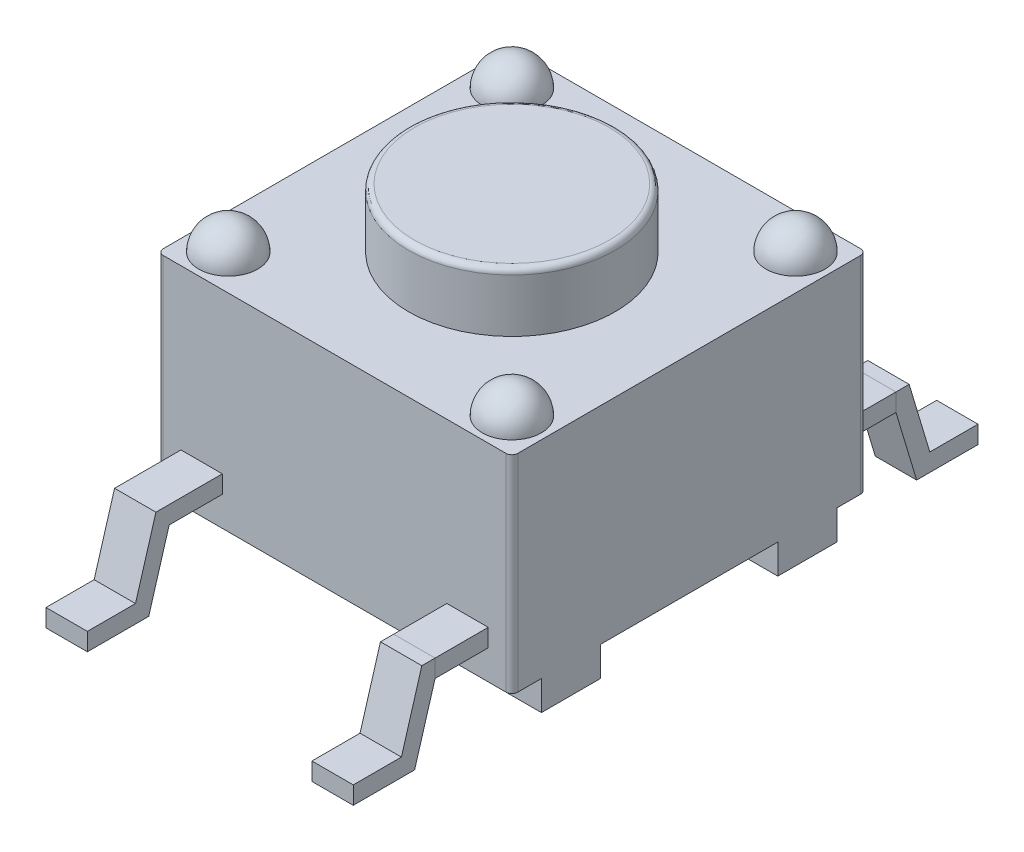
ISO-10303-21;
HEADER;
FILE_DESCRIPTION(('STEP AP214'),'2;1');
FILE_NAME('part.step','',(''),(''),'','','');
FILE_SCHEMA(('AUTOMOTIVE_DESIGN { 1 0 10303 214 1 1 1 1 }'));
ENDSEC;
DATA;
#1=APPLICATION_CONTEXT('core data for automotive mechanical design processes');
#2=APPLICATION_PROTOCOL_DEFINITION('international standard','automotive_design',2000,#1);
#3=PRODUCT_CONTEXT('',#1,'mechanical');
#4=PRODUCT('Part','Part','',(#3));
#5=PRODUCT_RELATED_PRODUCT_CATEGORY('part','',(#4));
#6=PRODUCT_DEFINITION_FORMATION('','',#4);
#7=PRODUCT_DEFINITION_CONTEXT('part definition',#1,'design');
#8=PRODUCT_DEFINITION('design','',#6,#7);
#9=PRODUCT_DEFINITION_SHAPE('','',#8);
#10=(LENGTH_UNIT() NAMED_UNIT(*) SI_UNIT(.MILLI.,.METRE.));
#11=(NAMED_UNIT(*) PLANE_ANGLE_UNIT() SI_UNIT($,.RADIAN.));
#12=(NAMED_UNIT(*) SI_UNIT($,.STERADIAN.) SOLID_ANGLE_UNIT());
#13=UNCERTAINTY_MEASURE_WITH_UNIT(LENGTH_MEASURE(1.E-05),#10,'distance_accuracy_value','');
#14=(GEOMETRIC_REPRESENTATION_CONTEXT(3) GLOBAL_UNCERTAINTY_ASSIGNED_CONTEXT((#13)) GLOBAL_UNIT_ASSIGNED_CONTEXT((#10,
#11,#12)) REPRESENTATION_CONTEXT('',''));
#15=CARTESIAN_POINT('',(0.,0.,0.));
#16=DIRECTION('',(0.,0.,1.));
#17=DIRECTION('',(1.,0.,0.));
#18=AXIS2_PLACEMENT_3D('',#15,#16,#17);
#19=CARTESIAN_POINT('',(0.,0.,0.));
#20=DIRECTION('',(0.,-1.,0.));
#21=DIRECTION('',(0.,0.,-1.));
#22=AXIS2_PLACEMENT_3D('',#19,#20,#21);
#23=PLANE('',#22);
#24=DIRECTION('',(1.,0.,0.));
#25=VECTOR('',#24,1.);
#26=CARTESIAN_POINT('',(-14.6463522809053,0.,-18.3860858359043));
#27=LINE('',#26,#25);
#28=CARTESIAN_POINT('',(-14.6463522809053,0.,-18.3860858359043));
#29=VERTEX_POINT('',#28);
#30=CARTESIAN_POINT('',(-8.64635228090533,0.,-18.3860858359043));
#31=VERTEX_POINT('',#30);
#32=EDGE_CURVE('P0_E614',#29,#31,#27,.T.);
#33=ORIENTED_EDGE('',*,*,#32,.T.);
#34=DIRECTION('',(0.,0.,-1.));
#35=VECTOR('',#34,1.);
#36=CARTESIAN_POINT('',(-8.64635228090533,0.,0.));
#37=LINE('',#36,#35);
#38=CARTESIAN_POINT('',(-8.64635228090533,0.,-17.3860858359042));
#39=VERTEX_POINT('',#38);
#40=EDGE_CURVE('P0_E608',#31,#39,#37,.F.);
#41=ORIENTED_EDGE('',*,*,#40,.T.);
#42=DIRECTION('',(-1.,0.,0.));
#43=VECTOR('',#42,1.);
#44=CARTESIAN_POINT('',(-14.6463522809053,0.,-17.3860858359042));
#45=LINE('',#44,#43);
#46=CARTESIAN_POINT('',(-14.6463522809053,0.,-17.3860858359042));
#47=VERTEX_POINT('',#46);
#48=EDGE_CURVE('P0_E648',#39,#47,#45,.T.);
#49=ORIENTED_EDGE('',*,*,#48,.T.);
#50=DIRECTION('',(0.,0.,-1.));
#51=VECTOR('',#50,1.);
#52=CARTESIAN_POINT('',(-14.6463522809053,0.,0.));
#53=LINE('',#52,#51);
#54=EDGE_CURVE('P0_E622',#47,#29,#53,.T.);
#55=ORIENTED_EDGE('',*,*,#54,.T.);
#56=EDGE_LOOP('',(#33,#41,#49,#55));
#57=FACE_BOUND('',#56,.T.);
#58=ADVANCED_FACE('P0_F19',(#57),#23,.T.);
#59=CARTESIAN_POINT('',(0.,0.,0.));
#60=DIRECTION('',(0.,-1.,0.));
#61=DIRECTION('',(0.,0.,-1.));
#62=AXIS2_PLACEMENT_3D('',#59,#60,#61);
#63=PLANE('',#62);
#64=DIRECTION('',(-1.,0.,0.));
#65=VECTOR('',#64,1.);
#66=CARTESIAN_POINT('',(-14.6463522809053,0.,-13.3860858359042));
#67=LINE('',#66,#65);
#68=CARTESIAN_POINT('',(-8.64635228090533,0.,-13.3860858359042));
#69=VERTEX_POINT('',#68);
#70=CARTESIAN_POINT('',(-14.6463522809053,0.,-13.3860858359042));
#71=VERTEX_POINT('',#70);
#72=EDGE_CURVE('P0_E463',#69,#71,#67,.T.);
#73=ORIENTED_EDGE('',*,*,#72,.T.);
#74=DIRECTION('',(0.,0.,-1.));
#75=VECTOR('',#74,1.);
#76=CARTESIAN_POINT('',(-14.6463522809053,0.,0.));
#77=LINE('',#76,#75);
#78=CARTESIAN_POINT('',(-14.6463522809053,0.,-14.3860858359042));
#79=VERTEX_POINT('',#78);
#80=EDGE_CURVE('P0_E584',#71,#79,#77,.T.);
#81=ORIENTED_EDGE('',*,*,#80,.T.);
#82=DIRECTION('',(1.,0.,0.));
#83=VECTOR('',#82,1.);
#84=CARTESIAN_POINT('',(-14.6463522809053,0.,-14.3860858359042));
#85=LINE('',#84,#83);
#86=CARTESIAN_POINT('',(-8.64635228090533,0.,-14.3860858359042));
#87=VERTEX_POINT('',#86);
#88=EDGE_CURVE('P0_E632',#79,#87,#85,.T.);
#89=ORIENTED_EDGE('',*,*,#88,.T.);
#90=DIRECTION('',(0.,0.,-1.));
#91=VECTOR('',#90,1.);
#92=CARTESIAN_POINT('',(-8.64635228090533,0.,0.));
#93=LINE('',#92,#91);
#94=EDGE_CURVE('P0_E588',#87,#69,#93,.F.);
#95=ORIENTED_EDGE('',*,*,#94,.T.);
#96=EDGE_LOOP('',(#73,#81,#89,#95));
#97=FACE_BOUND('',#96,.T.);
#98=ADVANCED_FACE('P0_F567',(#97),#63,.T.);
#99=CARTESIAN_POINT('',(-14.2463522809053,1.,-19.7860858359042));
#100=DIRECTION('',(0.,-0.287341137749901,0.957828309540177));
#101=DIRECTION('',(0.,-0.957828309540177,-0.287341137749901));
#102=AXIS2_PLACEMENT_3D('',#99,#100,#101);
#103=PLANE('',#102);
#104=DIRECTION('',(0.,0.957828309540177,0.287341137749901));
#105=VECTOR('',#104,1.);
#106=CARTESIAN_POINT('',(-14.2463522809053,-0.16669653,-20.1360858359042));
#107=LINE('',#106,#105);
#108=CARTESIAN_POINT('',(-14.2463522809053,-0.16669653,-20.1360858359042));
#109=VERTEX_POINT('',#108);
#110=CARTESIAN_POINT('',(-14.2463522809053,1.,-19.7860858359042));
#111=VERTEX_POINT('',#110);
#112=EDGE_CURVE('P0_E439',#109,#111,#107,.T.);
#113=ORIENTED_EDGE('',*,*,#112,.F.);
#114=DIRECTION('',(1.,0.,0.));
#115=VECTOR('',#114,1.);
#116=CARTESIAN_POINT('',(-14.2463522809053,-0.16669653,-20.1360858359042));
#117=LINE('',#116,#115);
#118=CARTESIAN_POINT('',(-13.5463522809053,-0.16669653,-20.1360858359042));
#119=VERTEX_POINT('',#118);
#120=EDGE_CURVE('P0_E603',#119,#109,#117,.F.);
#121=ORIENTED_EDGE('',*,*,#120,.F.);
#122=DIRECTION('',(0.,-0.957828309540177,-0.287341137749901));
#123=VECTOR('',#122,1.);
#124=CARTESIAN_POINT('',(-13.5463522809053,1.,-19.7860858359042));
#125=LINE('',#124,#123);
#126=CARTESIAN_POINT('',(-13.5463522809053,1.,-19.7860858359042));
#127=VERTEX_POINT('',#126);
#128=EDGE_CURVE('P0_E424',#127,#119,#125,.T.);
#129=ORIENTED_EDGE('',*,*,#128,.F.);
#130=DIRECTION('',(1.,0.,0.));
#131=VECTOR('',#130,1.);
#132=CARTESIAN_POINT('',(-4.5,1.,-19.7860858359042));
#133=LINE('',#132,#131);
#134=EDGE_CURVE('P0_E459',#127,#111,#133,.F.);
#135=ORIENTED_EDGE('',*,*,#134,.T.);
#136=EDGE_LOOP('',(#113,#121,#129,#135));
#137=FACE_BOUND('',#136,.T.);
#138=ADVANCED_FACE('P0_F564',(#137),#103,.T.);
#139=CARTESIAN_POINT('',(-14.2463522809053,-0.16669653,-20.1360858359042));
#140=DIRECTION('',(0.,-1.,0.));
#141=DIRECTION('',(0.,0.,-1.));
#142=AXIS2_PLACEMENT_3D('',#139,#140,#141);
#143=PLANE('',#142);
#144=DIRECTION('',(0.,0.,1.));
#145=VECTOR('',#144,1.);
#146=CARTESIAN_POINT('',(-14.2463522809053,-0.16669653,-19.7860858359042));
#147=LINE('',#146,#145);
#148=CARTESIAN_POINT('',(-14.2463522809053,-0.16669653,-21.1746608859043));
#149=VERTEX_POINT('',#148);
#150=EDGE_CURVE('P0_E443',#149,#109,#147,.T.);
#151=ORIENTED_EDGE('',*,*,#150,.F.);
#152=DIRECTION('',(-1.,0.,0.));
#153=VECTOR('',#152,1.);
#154=CARTESIAN_POINT('',(-14.2463522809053,-0.16669653,-21.1746608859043));
#155=LINE('',#154,#153);
#156=CARTESIAN_POINT('',(-13.5463522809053,-0.16669653,-21.1746608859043));
#157=VERTEX_POINT('',#156);
#158=EDGE_CURVE('P0_E829',#157,#149,#155,.T.);
#159=ORIENTED_EDGE('',*,*,#158,.F.);
#160=DIRECTION('',(0.,0.,-1.));
#161=VECTOR('',#160,1.);
#162=CARTESIAN_POINT('',(-13.5463522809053,-0.16669653,-18.8860858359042));
#163=LINE('',#162,#161);
#164=EDGE_CURVE('P0_E421',#119,#157,#163,.T.);
#165=ORIENTED_EDGE('',*,*,#164,.F.);
#166=ORIENTED_EDGE('',*,*,#120,.T.);
#167=EDGE_LOOP('',(#151,#159,#165,#166));
#168=FACE_BOUND('',#167,.T.);
#169=ADVANCED_FACE('P0_F560',(#168),#143,.T.);
#170=CARTESIAN_POINT('',(-14.2463522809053,0.13330347,-21.1746608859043));
#171=DIRECTION('',(0.,0.,-1.));
#172=DIRECTION('',(-1.,0.,0.));
#173=AXIS2_PLACEMENT_3D('',#170,#171,#172);
#174=PLANE('',#173);
#175=DIRECTION('',(0.,1.,0.));
#176=VECTOR('',#175,1.);
#177=CARTESIAN_POINT('',(-14.2463522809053,1.3,-21.1746608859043));
#178=LINE('',#177,#176);
#179=CARTESIAN_POINT('',(-14.2463522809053,0.13330347,-21.1746608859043));
#180=VERTEX_POINT('',#179);
#181=EDGE_CURVE('P0_E446',#180,#149,#178,.F.);
#182=ORIENTED_EDGE('',*,*,#181,.F.);
#183=DIRECTION('',(1.,0.,0.));
#184=VECTOR('',#183,1.);
#185=CARTESIAN_POINT('',(-14.2463522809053,0.13330347,-21.1746608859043));
#186=LINE('',#185,#184);
#187=CARTESIAN_POINT('',(-13.5463522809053,0.13330347,-21.1746608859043));
#188=VERTEX_POINT('',#187);
#189=EDGE_CURVE('P0_E827',#188,#180,#186,.F.);
#190=ORIENTED_EDGE('',*,*,#189,.F.);
#191=DIRECTION('',(0.,1.,0.));
#192=VECTOR('',#191,1.);
#193=CARTESIAN_POINT('',(-13.5463522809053,1.3,-21.1746608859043));
#194=LINE('',#193,#192);
#195=EDGE_CURVE('P0_E418',#157,#188,#194,.T.);
#196=ORIENTED_EDGE('',*,*,#195,.F.);
#197=ORIENTED_EDGE('',*,*,#158,.T.);
#198=EDGE_LOOP('',(#182,#190,#196,#197));
#199=FACE_BOUND('',#198,.T.);
#200=ADVANCED_FACE('P0_F556',(#199),#174,.T.);
#201=CARTESIAN_POINT('',(-14.2463522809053,0.13330347,-20.3592966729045));
#202=DIRECTION('',(0.,1.,0.));
#203=DIRECTION('',(0.,0.,1.));
#204=AXIS2_PLACEMENT_3D('',#201,#202,#203);
#205=PLANE('',#204);
#206=DIRECTION('',(0.,0.,1.));
#207=VECTOR('',#206,1.);
#208=CARTESIAN_POINT('',(-14.2463522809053,0.13330347,-19.7860858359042));
#209=LINE('',#208,#207);
#210=CARTESIAN_POINT('',(-14.2463522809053,0.13330347,-20.3592966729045));
#211=VERTEX_POINT('',#210);
#212=EDGE_CURVE('P0_E449',#211,#180,#209,.F.);
#213=ORIENTED_EDGE('',*,*,#212,.F.);
#214=DIRECTION('',(1.,0.,0.));
#215=VECTOR('',#214,1.);
#216=CARTESIAN_POINT('',(-14.2463522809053,0.13330347,-20.3592966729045));
#217=LINE('',#216,#215);
#218=CARTESIAN_POINT('',(-13.5463522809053,0.13330347,-20.3592966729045));
#219=VERTEX_POINT('',#218);
#220=EDGE_CURVE('P0_E816',#219,#211,#217,.F.);
#221=ORIENTED_EDGE('',*,*,#220,.F.);
#222=DIRECTION('',(0.,0.,-1.));
#223=VECTOR('',#222,1.);
#224=CARTESIAN_POINT('',(-13.5463522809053,0.13330347,-18.8860858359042));
#225=LINE('',#224,#223);
#226=EDGE_CURVE('P0_E415',#188,#219,#225,.F.);
#227=ORIENTED_EDGE('',*,*,#226,.F.);
#228=ORIENTED_EDGE('',*,*,#189,.T.);
#229=EDGE_LOOP('',(#213,#221,#227,#228));
#230=FACE_BOUND('',#229,.T.);
#231=ADVANCED_FACE('P0_F552',(#230),#205,.T.);
#232=CARTESIAN_POINT('',(-14.2463522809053,1.3,-20.0092966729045));
#233=DIRECTION('',(0.,0.287341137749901,-0.957828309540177));
#234=DIRECTION('',(0.,0.957828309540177,0.287341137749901));
#235=AXIS2_PLACEMENT_3D('',#232,#233,#234);
#236=PLANE('',#235);
#237=DIRECTION('',(0.,-0.957828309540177,-0.287341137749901));
#238=VECTOR('',#237,1.);
#239=CARTESIAN_POINT('',(-14.2463522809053,1.3,-20.0092966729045));
#240=LINE('',#239,#238);
#241=CARTESIAN_POINT('',(-14.2463522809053,1.3,-20.0092966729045));
#242=VERTEX_POINT('',#241);
#243=EDGE_CURVE('P0_E452',#242,#211,#240,.T.);
#244=ORIENTED_EDGE('',*,*,#243,.F.);
#245=DIRECTION('',(1.,0.,0.));
#246=VECTOR('',#245,1.);
#247=CARTESIAN_POINT('',(-4.5,1.3,-20.0092966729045));
#248=LINE('',#247,#246);
#249=CARTESIAN_POINT('',(-13.5463522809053,1.3,-20.0092966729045));
#250=VERTEX_POINT('',#249);
#251=EDGE_CURVE('P0_E436',#250,#242,#248,.F.);
#252=ORIENTED_EDGE('',*,*,#251,.F.);
#253=DIRECTION('',(0.,0.957828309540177,0.287341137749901));
#254=VECTOR('',#253,1.);
#255=CARTESIAN_POINT('',(-13.5463522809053,0.13330347,-20.3592966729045));
#256=LINE('',#255,#254);
#257=EDGE_CURVE('P0_E412',#219,#250,#256,.T.);
#258=ORIENTED_EDGE('',*,*,#257,.F.);
#259=ORIENTED_EDGE('',*,*,#220,.T.);
#260=EDGE_LOOP('',(#244,#252,#258,#259));
#261=FACE_BOUND('',#260,.T.);
#262=ADVANCED_FACE('P0_F548',(#261),#236,.T.);
#263=CARTESIAN_POINT('',(-9.04635228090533,1.3,-19.7860858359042));
#264=DIRECTION('',(0.,0.,-1.));
#265=DIRECTION('',(-1.,0.,0.));
#266=AXIS2_PLACEMENT_3D('',#263,#264,#265);
#267=PLANE('',#266);
#268=DIRECTION('',(1.,0.,0.));
#269=VECTOR('',#268,1.);
#270=CARTESIAN_POINT('',(0.,1.3,-19.7860858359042));
#271=LINE('',#270,#269);
#272=CARTESIAN_POINT('',(-9.04635228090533,1.3,-19.7860858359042));
#273=VERTEX_POINT('',#272);
#274=CARTESIAN_POINT('',(-9.74635228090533,1.3,-19.7860858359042));
#275=VERTEX_POINT('',#274);
#276=EDGE_CURVE('P0_E396',#273,#275,#271,.F.);
#277=ORIENTED_EDGE('',*,*,#276,.F.);
#278=DIRECTION('',(0.,1.,0.));
#279=VECTOR('',#278,1.);
#280=CARTESIAN_POINT('',(-9.04635228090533,1.3,-19.7860858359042));
#281=LINE('',#280,#279);
#282=CARTESIAN_POINT('',(-9.04635228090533,1.,-19.7860858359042));
#283=VERTEX_POINT('',#282);
#284=EDGE_CURVE('P0_E387',#283,#273,#281,.T.);
#285=ORIENTED_EDGE('',*,*,#284,.F.);
#286=DIRECTION('',(1.,0.,0.));
#287=VECTOR('',#286,1.);
#288=CARTESIAN_POINT('',(0.,1.,-19.7860858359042));
#289=LINE('',#288,#287);
#290=CARTESIAN_POINT('',(-9.74635228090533,1.,-19.7860858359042));
#291=VERTEX_POINT('',#290);
#292=EDGE_CURVE('P0_E405',#283,#291,#289,.F.);
#293=ORIENTED_EDGE('',*,*,#292,.T.);
#294=DIRECTION('',(0.,1.,0.));
#295=VECTOR('',#294,1.);
#296=CARTESIAN_POINT('',(-9.74635228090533,1.3,-19.7860858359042));
#297=LINE('',#296,#295);
#298=EDGE_CURVE('P0_E399',#275,#291,#297,.F.);
#299=ORIENTED_EDGE('',*,*,#298,.F.);
#300=EDGE_LOOP('',(#277,#285,#293,#299));
#301=FACE_BOUND('',#300,.T.);
#302=ADVANCED_FACE('P0_F544',(#301),#267,.T.);
#303=CARTESIAN_POINT('',(-14.6463522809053,0.5,-18.3860858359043));
#304=DIRECTION('',(0.,0.,1.));
#305=DIRECTION('',(1.,0.,0.));
#306=AXIS2_PLACEMENT_3D('',#303,#304,#305);
#307=PLANE('',#306);
#308=DIRECTION('',(0.,1.,0.));
#309=VECTOR('',#308,1.);
#310=CARTESIAN_POINT('',(-14.6463522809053,0.5,-18.3860858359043));
#311=LINE('',#310,#309);
#312=CARTESIAN_POINT('',(-14.6463522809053,0.5,-18.3860858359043));
#313=VERTEX_POINT('',#312);
#314=EDGE_CURVE('P0_E619',#313,#29,#311,.F.);
#315=ORIENTED_EDGE('',*,*,#314,.F.);
#316=DIRECTION('',(1.,0.,0.));
#317=VECTOR('',#316,1.);
#318=CARTESIAN_POINT('',(0.,0.5,-18.3860858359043));
#319=LINE('',#318,#317);
#320=CARTESIAN_POINT('',(-8.64635228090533,0.5,-18.3860858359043));
#321=VERTEX_POINT('',#320);
#322=EDGE_CURVE('P0_E382',#313,#321,#319,.T.);
#323=ORIENTED_EDGE('',*,*,#322,.T.);
#324=DIRECTION('',(0.,1.,0.));
#325=VECTOR('',#324,1.);
#326=CARTESIAN_POINT('',(-8.64635228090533,0.5,-18.3860858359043));
#327=LINE('',#326,#325);
#328=EDGE_CURVE('P0_E809',#31,#321,#327,.T.);
#329=ORIENTED_EDGE('',*,*,#328,.F.);
#330=ORIENTED_EDGE('',*,*,#32,.F.);
#331=EDGE_LOOP('',(#315,#323,#329,#330));
#332=FACE_BOUND('',#331,.T.);
#333=ADVANCED_FACE('P0_F540',(#332),#307,.F.);
#334=CARTESIAN_POINT('',(-14.6463522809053,0.5,-14.3860858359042));
#335=DIRECTION('',(0.,0.,1.));
#336=DIRECTION('',(1.,0.,0.));
#337=AXIS2_PLACEMENT_3D('',#334,#335,#336);
#338=PLANE('',#337);
#339=DIRECTION('',(0.,1.,0.));
#340=VECTOR('',#339,1.);
#341=CARTESIAN_POINT('',(-14.6463522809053,0.5,-14.3860858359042));
#342=LINE('',#341,#340);
#343=CARTESIAN_POINT('',(-14.6463522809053,0.5,-14.3860858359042));
#344=VERTEX_POINT('',#343);
#345=EDGE_CURVE('P0_E636',#344,#79,#342,.F.);
#346=ORIENTED_EDGE('',*,*,#345,.F.);
#347=DIRECTION('',(1.,0.,0.));
#348=VECTOR('',#347,1.);
#349=CARTESIAN_POINT('',(0.,0.5,-14.3860858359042));
#350=LINE('',#349,#348);
#351=CARTESIAN_POINT('',(-8.64635228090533,0.5,-14.3860858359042));
#352=VERTEX_POINT('',#351);
#353=EDGE_CURVE('P0_E372',#344,#352,#350,.T.);
#354=ORIENTED_EDGE('',*,*,#353,.T.);
#355=DIRECTION('',(0.,1.,0.));
#356=VECTOR('',#355,1.);
#357=CARTESIAN_POINT('',(-8.64635228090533,0.5,-14.3860858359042));
#358=LINE('',#357,#356);
#359=EDGE_CURVE('P0_E618',#87,#352,#358,.T.);
#360=ORIENTED_EDGE('',*,*,#359,.F.);
#361=ORIENTED_EDGE('',*,*,#88,.F.);
#362=EDGE_LOOP('',(#346,#354,#360,#361));
#363=FACE_BOUND('',#362,.T.);
#364=ADVANCED_FACE('P0_F536',(#363),#338,.F.);
#365=CARTESIAN_POINT('',(-14.6463522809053,0.5,-17.3860858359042));
#366=DIRECTION('',(0.,0.,-1.));
#367=DIRECTION('',(-1.,0.,0.));
#368=AXIS2_PLACEMENT_3D('',#365,#366,#367);
#369=PLANE('',#368);
#370=DIRECTION('',(0.,1.,0.));
#371=VECTOR('',#370,1.);
#372=CARTESIAN_POINT('',(-8.64635228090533,0.5,-17.3860858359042));
#373=LINE('',#372,#371);
#374=CARTESIAN_POINT('',(-8.64635228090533,0.5,-17.3860858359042));
#375=VERTEX_POINT('',#374);
#376=EDGE_CURVE('P0_E653',#375,#39,#373,.F.);
#377=ORIENTED_EDGE('',*,*,#376,.F.);
#378=DIRECTION('',(1.,0.,0.));
#379=VECTOR('',#378,1.);
#380=CARTESIAN_POINT('',(0.,0.5,-17.3860858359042));
#381=LINE('',#380,#379);
#382=CARTESIAN_POINT('',(-14.6463522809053,0.5,-17.3860858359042));
#383=VERTEX_POINT('',#382);
#384=EDGE_CURVE('P0_E354',#375,#383,#381,.F.);
#385=ORIENTED_EDGE('',*,*,#384,.T.);
#386=DIRECTION('',(0.,1.,0.));
#387=VECTOR('',#386,1.);
#388=CARTESIAN_POINT('',(-14.6463522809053,0.5,-17.3860858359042));
#389=LINE('',#388,#387);
#390=EDGE_CURVE('P0_E635',#47,#383,#389,.T.);
#391=ORIENTED_EDGE('',*,*,#390,.F.);
#392=ORIENTED_EDGE('',*,*,#48,.F.);
#393=EDGE_LOOP('',(#377,#385,#391,#392));
#394=FACE_BOUND('',#393,.T.);
#395=ADVANCED_FACE('P0_F532',(#394),#369,.F.);
#396=CARTESIAN_POINT('',(-14.2463522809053,1.,-11.9860858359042));
#397=DIRECTION('',(0.,-0.284084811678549,-0.958799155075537));
#398=DIRECTION('',(0.,0.958799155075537,-0.284084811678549));
#399=AXIS2_PLACEMENT_3D('',#396,#397,#398);
#400=PLANE('',#399);
#401=DIRECTION('',(0.,-0.958799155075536,0.28408481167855));
#402=VECTOR('',#401,1.);
#403=CARTESIAN_POINT('',(-14.2463522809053,1.,-11.9860858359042));
#404=LINE('',#403,#402);
#405=CARTESIAN_POINT('',(-14.2463522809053,1.,-11.9860858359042));
#406=VERTEX_POINT('',#405);
#407=CARTESIAN_POINT('',(-14.2463522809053,-0.166696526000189,-11.6404026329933));
#408=VERTEX_POINT('',#407);
#409=EDGE_CURVE('P0_E310',#406,#408,#404,.T.);
#410=ORIENTED_EDGE('',*,*,#409,.F.);
#411=DIRECTION('',(1.,0.,0.));
#412=VECTOR('',#411,1.);
#413=CARTESIAN_POINT('',(-4.5,1.,-11.9860858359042));
#414=LINE('',#413,#412);
#415=CARTESIAN_POINT('',(-13.5463522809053,1.,-11.9860858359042));
#416=VERTEX_POINT('',#415);
#417=EDGE_CURVE('P0_E350',#406,#416,#414,.T.);
#418=ORIENTED_EDGE('',*,*,#417,.T.);
#419=DIRECTION('',(0.,0.958799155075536,-0.28408481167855));
#420=VECTOR('',#419,1.);
#421=CARTESIAN_POINT('',(-13.5463522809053,-0.166696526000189,-11.6404026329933));
#422=LINE('',#421,#420);
#423=CARTESIAN_POINT('',(-13.5463522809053,-0.166696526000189,-11.6404026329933));
#424=VERTEX_POINT('',#423);
#425=EDGE_CURVE('P0_E326',#424,#416,#422,.T.);
#426=ORIENTED_EDGE('',*,*,#425,.F.);
#427=DIRECTION('',(1.,0.,0.));
#428=VECTOR('',#427,1.);
#429=CARTESIAN_POINT('',(-14.2463522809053,-0.166696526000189,-11.6404026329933));
#430=LINE('',#429,#428);
#431=EDGE_CURVE('P0_E652',#408,#424,#430,.T.);
#432=ORIENTED_EDGE('',*,*,#431,.F.);
#433=EDGE_LOOP('',(#410,#418,#426,#432));
#434=FACE_BOUND('',#433,.T.);
#435=ADVANCED_FACE('P0_F528',(#434),#400,.T.);
#436=CARTESIAN_POINT('',(-14.2463522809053,-0.166696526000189,-11.6404026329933));
#437=DIRECTION('',(0.,-1.,0.));
#438=DIRECTION('',(0.,0.,-1.));
#439=AXIS2_PLACEMENT_3D('',#436,#437,#438);
#440=PLANE('',#439);
#441=DIRECTION('',(0.,0.,1.));
#442=VECTOR('',#441,1.);
#443=CARTESIAN_POINT('',(-14.2463522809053,-0.166696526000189,-12.8860858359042));
#444=LINE('',#443,#442);
#445=CARTESIAN_POINT('',(-14.2463522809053,-0.166696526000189,-10.6018275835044));
#446=VERTEX_POINT('',#445);
#447=EDGE_CURVE('P0_E306',#408,#446,#444,.T.);
#448=ORIENTED_EDGE('',*,*,#447,.F.);
#449=ORIENTED_EDGE('',*,*,#431,.T.);
#450=DIRECTION('',(0.,0.,-1.));
#451=VECTOR('',#450,1.);
#452=CARTESIAN_POINT('',(-13.5463522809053,-0.166696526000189,-12.8860858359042));
#453=LINE('',#452,#451);
#454=CARTESIAN_POINT('',(-13.5463522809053,-0.166696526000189,-10.6018275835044));
#455=VERTEX_POINT('',#454);
#456=EDGE_CURVE('P0_E330',#455,#424,#453,.T.);
#457=ORIENTED_EDGE('',*,*,#456,.F.);
#458=DIRECTION('',(1.,0.,0.));
#459=VECTOR('',#458,1.);
#460=CARTESIAN_POINT('',(-14.2463522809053,-0.166696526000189,-10.6018275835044));
#461=LINE('',#460,#459);
#462=EDGE_CURVE('P0_E1074',#446,#455,#461,.T.);
#463=ORIENTED_EDGE('',*,*,#462,.F.);
#464=EDGE_LOOP('',(#448,#449,#457,#463));
#465=FACE_BOUND('',#464,.T.);
#466=ADVANCED_FACE('P0_F524',(#465),#440,.T.);
#467=CARTESIAN_POINT('',(-14.2463522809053,0.133303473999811,-10.6018275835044));
#468=DIRECTION('',(0.,0.,1.));
#469=DIRECTION('',(1.,0.,0.));
#470=AXIS2_PLACEMENT_3D('',#467,#468,#469);
#471=PLANE('',#470);
#472=DIRECTION('',(0.,1.,0.));
#473=VECTOR('',#472,1.);
#474=CARTESIAN_POINT('',(-14.2463522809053,1.3,-10.6018275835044));
#475=LINE('',#474,#473);
#476=CARTESIAN_POINT('',(-14.2463522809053,0.133303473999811,-10.6018275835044));
#477=VERTEX_POINT('',#476);
#478=EDGE_CURVE('P0_E302',#446,#477,#475,.T.);
#479=ORIENTED_EDGE('',*,*,#478,.F.);
#480=ORIENTED_EDGE('',*,*,#462,.T.);
#481=DIRECTION('',(0.,1.,0.));
#482=VECTOR('',#481,1.);
#483=CARTESIAN_POINT('',(-13.5463522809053,1.3,-10.6018275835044));
#484=LINE('',#483,#482);
#485=CARTESIAN_POINT('',(-13.5463522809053,0.133303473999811,-10.6018275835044));
#486=VERTEX_POINT('',#485);
#487=EDGE_CURVE('P0_E334',#486,#455,#484,.F.);
#488=ORIENTED_EDGE('',*,*,#487,.F.);
#489=DIRECTION('',(1.,0.,0.));
#490=VECTOR('',#489,1.);
#491=CARTESIAN_POINT('',(-14.2463522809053,0.133303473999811,-10.6018275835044));
#492=LINE('',#491,#490);
#493=EDGE_CURVE('P0_E1071',#477,#486,#492,.T.);
#494=ORIENTED_EDGE('',*,*,#493,.F.);
#495=EDGE_LOOP('',(#479,#480,#488,#494));
#496=FACE_BOUND('',#495,.T.);
#497=ADVANCED_FACE('P0_F520',(#496),#471,.T.);
#498=CARTESIAN_POINT('',(-14.2463522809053,0.133303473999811,-11.4163989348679));
#499=DIRECTION('',(0.,1.,0.));
#500=DIRECTION('',(0.,0.,1.));
#501=AXIS2_PLACEMENT_3D('',#498,#499,#500);
#502=PLANE('',#501);
#503=DIRECTION('',(0.,0.,1.));
#504=VECTOR('',#503,1.);
#505=CARTESIAN_POINT('',(-14.2463522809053,0.133303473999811,-12.8860858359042));
#506=LINE('',#505,#504);
#507=CARTESIAN_POINT('',(-14.2463522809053,0.133303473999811,-11.4163989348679));
#508=VERTEX_POINT('',#507);
#509=EDGE_CURVE('P0_E298',#477,#508,#506,.F.);
#510=ORIENTED_EDGE('',*,*,#509,.F.);
#511=ORIENTED_EDGE('',*,*,#493,.T.);
#512=DIRECTION('',(0.,0.,-1.));
#513=VECTOR('',#512,1.);
#514=CARTESIAN_POINT('',(-13.5463522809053,0.133303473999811,-12.8860858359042));
#515=LINE('',#514,#513);
#516=CARTESIAN_POINT('',(-13.5463522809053,0.133303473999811,-11.4163989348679));
#517=VERTEX_POINT('',#516);
#518=EDGE_CURVE('P0_E338',#517,#486,#515,.F.);
#519=ORIENTED_EDGE('',*,*,#518,.F.);
#520=DIRECTION('',(1.,0.,0.));
#521=VECTOR('',#520,1.);
#522=CARTESIAN_POINT('',(-14.2463522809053,0.133303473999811,-11.4163989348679));
#523=LINE('',#522,#521);
#524=EDGE_CURVE('P0_E1066',#508,#517,#523,.T.);
#525=ORIENTED_EDGE('',*,*,#524,.F.);
#526=EDGE_LOOP('',(#510,#511,#519,#525));
#527=FACE_BOUND('',#526,.T.);
#528=ADVANCED_FACE('P0_F516',(#527),#502,.T.);
#529=CARTESIAN_POINT('',(-14.2463522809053,1.3,-11.7620821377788));
#530=DIRECTION('',(0.,0.28408481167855,0.958799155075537));
#531=DIRECTION('',(0.,-0.958799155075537,0.28408481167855));
#532=AXIS2_PLACEMENT_3D('',#529,#530,#531);
#533=PLANE('',#532);
#534=DIRECTION('',(0.,0.958799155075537,-0.284084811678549));
#535=VECTOR('',#534,1.);
#536=CARTESIAN_POINT('',(-14.2463522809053,0.133303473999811,-11.4163989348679));
#537=LINE('',#536,#535);
#538=CARTESIAN_POINT('',(-14.2463522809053,1.3,-11.7620821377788));
#539=VERTEX_POINT('',#538);
#540=EDGE_CURVE('P0_E295',#508,#539,#537,.T.);
#541=ORIENTED_EDGE('',*,*,#540,.F.);
#542=ORIENTED_EDGE('',*,*,#524,.T.);
#543=DIRECTION('',(0.,-0.958799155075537,0.284084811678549));
#544=VECTOR('',#543,1.);
#545=CARTESIAN_POINT('',(-13.5463522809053,1.3,-11.7620821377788));
#546=LINE('',#545,#544);
#547=CARTESIAN_POINT('',(-13.5463522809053,1.3,-11.7620821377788));
#548=VERTEX_POINT('',#547);
#549=EDGE_CURVE('P0_E342',#548,#517,#546,.T.);
#550=ORIENTED_EDGE('',*,*,#549,.F.);
#551=DIRECTION('',(1.,0.,0.));
#552=VECTOR('',#551,1.);
#553=CARTESIAN_POINT('',(-4.5,1.3,-11.7620821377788));
#554=LINE('',#553,#552);
#555=EDGE_CURVE('P0_E322',#539,#548,#554,.T.);
#556=ORIENTED_EDGE('',*,*,#555,.F.);
#557=EDGE_LOOP('',(#541,#542,#550,#556));
#558=FACE_BOUND('',#557,.T.);
#559=ADVANCED_FACE('P0_F512',(#558),#533,.T.);
#560=CARTESIAN_POINT('',(-9.74635228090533,1.3,-11.9860858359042));
#561=DIRECTION('',(0.,0.,1.));
#562=DIRECTION('',(1.,0.,0.));
#563=AXIS2_PLACEMENT_3D('',#560,#561,#562);
#564=PLANE('',#563);
#565=DIRECTION('',(1.,0.,0.));
#566=VECTOR('',#565,1.);
#567=CARTESIAN_POINT('',(0.,1.3,-11.9860858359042));
#568=LINE('',#567,#566);
#569=CARTESIAN_POINT('',(-9.74635228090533,1.3,-11.9860858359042));
#570=VERTEX_POINT('',#569);
#571=CARTESIAN_POINT('',(-9.04635228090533,1.3,-11.9860858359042));
#572=VERTEX_POINT('',#571);
#573=EDGE_CURVE('P0_E279',#570,#572,#568,.T.);
#574=ORIENTED_EDGE('',*,*,#573,.F.);
#575=DIRECTION('',(0.,1.,0.));
#576=VECTOR('',#575,1.);
#577=CARTESIAN_POINT('',(-9.74635228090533,1.3,-11.9860858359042));
#578=LINE('',#577,#576);
#579=CARTESIAN_POINT('',(-9.74635228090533,1.,-11.9860858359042));
#580=VERTEX_POINT('',#579);
#581=EDGE_CURVE('P0_E270',#580,#570,#578,.T.);
#582=ORIENTED_EDGE('',*,*,#581,.F.);
#583=DIRECTION('',(1.,0.,0.));
#584=VECTOR('',#583,1.);
#585=CARTESIAN_POINT('',(0.,1.,-11.9860858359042));
#586=LINE('',#585,#584);
#587=CARTESIAN_POINT('',(-9.04635228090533,1.,-11.9860858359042));
#588=VERTEX_POINT('',#587);
#589=EDGE_CURVE('P0_E288',#580,#588,#586,.T.);
#590=ORIENTED_EDGE('',*,*,#589,.T.);
#591=DIRECTION('',(0.,1.,0.));
#592=VECTOR('',#591,1.);
#593=CARTESIAN_POINT('',(-9.04635228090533,1.3,-11.9860858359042));
#594=LINE('',#593,#592);
#595=EDGE_CURVE('P0_E282',#572,#588,#594,.F.);
#596=ORIENTED_EDGE('',*,*,#595,.F.);
#597=EDGE_LOOP('',(#574,#582,#590,#596));
#598=FACE_BOUND('',#597,.T.);
#599=ADVANCED_FACE('P0_F508',(#598),#564,.T.);
#600=CARTESIAN_POINT('',(-14.6463522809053,0.5,-13.3860858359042));
#601=DIRECTION('',(0.,0.,-1.));
#602=DIRECTION('',(-1.,0.,0.));
#603=AXIS2_PLACEMENT_3D('',#600,#601,#602);
#604=PLANE('',#603);
#605=DIRECTION('',(0.,1.,0.));
#606=VECTOR('',#605,1.);
#607=CARTESIAN_POINT('',(-8.64635228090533,0.5,-13.3860858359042));
#608=LINE('',#607,#606);
#609=CARTESIAN_POINT('',(-8.64635228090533,0.5,-13.3860858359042));
#610=VERTEX_POINT('',#609);
#611=EDGE_CURVE('P0_E596',#610,#69,#608,.F.);
#612=ORIENTED_EDGE('',*,*,#611,.F.);
#613=DIRECTION('',(1.,0.,0.));
#614=VECTOR('',#613,1.);
#615=CARTESIAN_POINT('',(0.,0.5,-13.3860858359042));
#616=LINE('',#615,#614);
#617=CARTESIAN_POINT('',(-14.6463522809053,0.5,-13.3860858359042));
#618=VERTEX_POINT('',#617);
#619=EDGE_CURVE('P0_E362',#618,#610,#616,.T.);
#620=ORIENTED_EDGE('',*,*,#619,.F.);
#621=DIRECTION('',(0.,1.,0.));
#622=VECTOR('',#621,1.);
#623=CARTESIAN_POINT('',(-14.6463522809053,0.5,-13.3860858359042));
#624=LINE('',#623,#622);
#625=EDGE_CURVE('P0_E599',#71,#618,#624,.T.);
#626=ORIENTED_EDGE('',*,*,#625,.F.);
#627=ORIENTED_EDGE('',*,*,#72,.F.);
#628=EDGE_LOOP('',(#612,#620,#626,#627));
#629=FACE_BOUND('',#628,.T.);
#630=ADVANCED_FACE('P0_F504',(#629),#604,.F.);
#631=CARTESIAN_POINT('',(-11.6463522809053,5.,-15.8860858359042));
#632=DIRECTION('',(0.,1.,0.));
#633=DIRECTION('',(0.,0.,1.));
#634=AXIS2_PLACEMENT_3D('',#631,#632,#633);
#635=PLANE('',#634);
#636=CARTESIAN_POINT('',(-11.6463522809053,5.,-15.8860858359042));
#637=DIRECTION('',(0.,-1.,0.));
#638=DIRECTION('',(0.,0.,1.));
#639=AXIS2_PLACEMENT_3D('',#636,#637,#638);
#640=CIRCLE('',#639,1.65);
#641=CARTESIAN_POINT('',(-11.6463522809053,5.,-14.2360858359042));
#642=VERTEX_POINT('',#641);
#643=EDGE_CURVE('P0_E366',#642,#642,#640,.T.);
#644=ORIENTED_EDGE('',*,*,#643,.F.);
#645=EDGE_LOOP('',(#644));
#646=FACE_BOUND('',#645,.T.);
#647=ADVANCED_FACE('P0_F493',(#646),#635,.T.);
#648=CARTESIAN_POINT('',(-4.5,1.,0.));
#649=DIRECTION('',(0.,1.,0.));
#650=DIRECTION('',(0.,0.,1.));
#651=AXIS2_PLACEMENT_3D('',#648,#649,#650);
#652=PLANE('',#651);
#653=DIRECTION('',(0.,0.,1.));
#654=VECTOR('',#653,1.);
#655=CARTESIAN_POINT('',(-14.2463522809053,1.,-19.7860858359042));
#656=LINE('',#655,#654);
#657=CARTESIAN_POINT('',(-14.2463522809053,1.,-18.8860858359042));
#658=VERTEX_POINT('',#657);
#659=EDGE_CURVE('P0_E455',#111,#658,#656,.T.);
#660=ORIENTED_EDGE('',*,*,#659,.F.);
#661=ORIENTED_EDGE('',*,*,#134,.F.);
#662=DIRECTION('',(0.,0.,-1.));
#663=VECTOR('',#662,1.);
#664=CARTESIAN_POINT('',(-13.5463522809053,1.,-18.8860858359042));
#665=LINE('',#664,#663);
#666=CARTESIAN_POINT('',(-13.5463522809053,1.,-18.8860858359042));
#667=VERTEX_POINT('',#666);
#668=EDGE_CURVE('P0_E428',#667,#127,#665,.T.);
#669=ORIENTED_EDGE('',*,*,#668,.F.);
#670=DIRECTION('',(1.,0.,0.));
#671=VECTOR('',#670,1.);
#672=CARTESIAN_POINT('',(-14.6463522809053,1.,-18.8860858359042));
#673=LINE('',#672,#671);
#674=EDGE_CURVE('P0_E468',#667,#658,#673,.F.);
#675=ORIENTED_EDGE('',*,*,#674,.T.);
#676=EDGE_LOOP('',(#660,#661,#669,#675));
#677=FACE_BOUND('',#676,.T.);
#678=ADVANCED_FACE('P0_F503',(#677),#652,.F.);
#679=CARTESIAN_POINT('',(-14.2463522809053,1.3,-19.7860858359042));
#680=DIRECTION('',(-1.,0.,0.));
#681=DIRECTION('',(0.,0.,1.));
#682=AXIS2_PLACEMENT_3D('',#679,#680,#681);
#683=PLANE('',#682);
#684=ORIENTED_EDGE('',*,*,#150,.T.);
#685=ORIENTED_EDGE('',*,*,#112,.T.);
#686=ORIENTED_EDGE('',*,*,#659,.T.);
#687=DIRECTION('',(0.,1.,0.));
#688=VECTOR('',#687,1.);
#689=CARTESIAN_POINT('',(-14.2463522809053,4.,-18.8860858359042));
#690=LINE('',#689,#688);
#691=CARTESIAN_POINT('',(-14.2463522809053,1.3,-18.8860858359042));
#692=VERTEX_POINT('',#691);
#693=EDGE_CURVE('P0_E790',#658,#692,#690,.T.);
#694=ORIENTED_EDGE('',*,*,#693,.T.);
#695=DIRECTION('',(0.,0.,1.));
#696=VECTOR('',#695,1.);
#697=CARTESIAN_POINT('',(-14.2463522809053,1.3,0.));
#698=LINE('',#697,#696);
#699=EDGE_CURVE('P0_E432',#242,#692,#698,.T.);
#700=ORIENTED_EDGE('',*,*,#699,.F.);
#701=ORIENTED_EDGE('',*,*,#243,.T.);
#702=ORIENTED_EDGE('',*,*,#212,.T.);
#703=ORIENTED_EDGE('',*,*,#181,.T.);
#704=EDGE_LOOP('',(#684,#685,#686,#694,#700,#701,#702,#703));
#705=FACE_BOUND('',#704,.T.);
#706=ADVANCED_FACE('P0_F846',(#705),#683,.T.);
#707=CARTESIAN_POINT('',(-4.5,1.3,0.));
#708=DIRECTION('',(0.,1.,0.));
#709=DIRECTION('',(0.,0.,1.));
#710=AXIS2_PLACEMENT_3D('',#707,#708,#709);
#711=PLANE('',#710);
#712=ORIENTED_EDGE('',*,*,#251,.T.);
#713=ORIENTED_EDGE('',*,*,#699,.T.);
#714=DIRECTION('',(1.,0.,0.));
#715=VECTOR('',#714,1.);
#716=CARTESIAN_POINT('',(-14.6463522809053,1.3,-18.8860858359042));
#717=LINE('',#716,#715);
#718=CARTESIAN_POINT('',(-13.5463522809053,1.3,-18.8860858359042));
#719=VERTEX_POINT('',#718);
#720=EDGE_CURVE('P0_E786',#692,#719,#717,.T.);
#721=ORIENTED_EDGE('',*,*,#720,.T.);
#722=DIRECTION('',(0.,0.,-1.));
#723=VECTOR('',#722,1.);
#724=CARTESIAN_POINT('',(-13.5463522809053,1.3,-18.8860858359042));
#725=LINE('',#724,#723);
#726=EDGE_CURVE('P0_E408',#250,#719,#725,.F.);
#727=ORIENTED_EDGE('',*,*,#726,.F.);
#728=EDGE_LOOP('',(#712,#713,#721,#727));
#729=FACE_BOUND('',#728,.T.);
#730=ADVANCED_FACE('P0_F875',(#729),#711,.T.);
#731=CARTESIAN_POINT('',(-13.5463522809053,1.3,-18.8860858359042));
#732=DIRECTION('',(1.,0.,0.));
#733=DIRECTION('',(0.,0.,-1.));
#734=AXIS2_PLACEMENT_3D('',#731,#732,#733);
#735=PLANE('',#734);
#736=ORIENTED_EDGE('',*,*,#726,.T.);
#737=DIRECTION('',(0.,1.,0.));
#738=VECTOR('',#737,1.);
#739=CARTESIAN_POINT('',(-13.5463522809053,4.,-18.8860858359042));
#740=LINE('',#739,#738);
#741=EDGE_CURVE('P0_E782',#719,#667,#740,.F.);
#742=ORIENTED_EDGE('',*,*,#741,.T.);
#743=ORIENTED_EDGE('',*,*,#668,.T.);
#744=ORIENTED_EDGE('',*,*,#128,.T.);
#745=ORIENTED_EDGE('',*,*,#164,.T.);
#746=ORIENTED_EDGE('',*,*,#195,.T.);
#747=ORIENTED_EDGE('',*,*,#226,.T.);
#748=ORIENTED_EDGE('',*,*,#257,.T.);
#749=EDGE_LOOP('',(#736,#742,#743,#744,#745,#746,#747,#748));
#750=FACE_BOUND('',#749,.T.);
#751=ADVANCED_FACE('P0_F859',(#750),#735,.T.);
#752=CARTESIAN_POINT('',(0.,1.,0.));
#753=DIRECTION('',(0.,1.,0.));
#754=DIRECTION('',(0.,0.,1.));
#755=AXIS2_PLACEMENT_3D('',#752,#753,#754);
#756=PLANE('',#755);
#757=DIRECTION('',(0.,0.,1.));
#758=VECTOR('',#757,1.);
#759=CARTESIAN_POINT('',(-9.74635228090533,1.,-19.7860858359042));
#760=LINE('',#759,#758);
#761=CARTESIAN_POINT('',(-9.74635228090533,1.,-18.8860858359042));
#762=VERTEX_POINT('',#761);
#763=EDGE_CURVE('P0_E402',#291,#762,#760,.T.);
#764=ORIENTED_EDGE('',*,*,#763,.F.);
#765=ORIENTED_EDGE('',*,*,#292,.F.);
#766=DIRECTION('',(0.,0.,-1.));
#767=VECTOR('',#766,1.);
#768=CARTESIAN_POINT('',(-9.04635228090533,1.,-18.8860858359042));
#769=LINE('',#768,#767);
#770=CARTESIAN_POINT('',(-9.04635228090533,1.,-18.8860858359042));
#771=VERTEX_POINT('',#770);
#772=EDGE_CURVE('P0_E390',#771,#283,#769,.T.);
#773=ORIENTED_EDGE('',*,*,#772,.F.);
#774=DIRECTION('',(1.,0.,0.));
#775=VECTOR('',#774,1.);
#776=CARTESIAN_POINT('',(-14.6463522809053,1.,-18.8860858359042));
#777=LINE('',#776,#775);
#778=EDGE_CURVE('P0_E779',#771,#762,#777,.F.);
#779=ORIENTED_EDGE('',*,*,#778,.T.);
#780=EDGE_LOOP('',(#764,#765,#773,#779));
#781=FACE_BOUND('',#780,.T.);
#782=ADVANCED_FACE('P0_F1014',(#781),#756,.F.);
#783=CARTESIAN_POINT('',(-9.74635228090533,1.3,-19.7860858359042));
#784=DIRECTION('',(-1.,0.,0.));
#785=DIRECTION('',(0.,0.,1.));
#786=AXIS2_PLACEMENT_3D('',#783,#784,#785);
#787=PLANE('',#786);
#788=DIRECTION('',(0.,0.,1.));
#789=VECTOR('',#788,1.);
#790=CARTESIAN_POINT('',(-9.74635228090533,1.3,0.));
#791=LINE('',#790,#789);
#792=CARTESIAN_POINT('',(-9.74635228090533,1.3,-18.8860858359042));
#793=VERTEX_POINT('',#792);
#794=EDGE_CURVE('P0_E393',#275,#793,#791,.T.);
#795=ORIENTED_EDGE('',*,*,#794,.F.);
#796=ORIENTED_EDGE('',*,*,#298,.T.);
#797=ORIENTED_EDGE('',*,*,#763,.T.);
#798=DIRECTION('',(0.,1.,0.));
#799=VECTOR('',#798,1.);
#800=CARTESIAN_POINT('',(-9.74635228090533,4.,-18.8860858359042));
#801=LINE('',#800,#799);
#802=EDGE_CURVE('P0_E776',#762,#793,#801,.T.);
#803=ORIENTED_EDGE('',*,*,#802,.T.);
#804=EDGE_LOOP('',(#795,#796,#797,#803));
#805=FACE_BOUND('',#804,.T.);
#806=ADVANCED_FACE('P0_F1011',(#805),#787,.T.);
#807=CARTESIAN_POINT('',(0.,1.3,0.));
#808=DIRECTION('',(0.,1.,0.));
#809=DIRECTION('',(0.,0.,1.));
#810=AXIS2_PLACEMENT_3D('',#807,#808,#809);
#811=PLANE('',#810);
#812=ORIENTED_EDGE('',*,*,#276,.T.);
#813=ORIENTED_EDGE('',*,*,#794,.T.);
#814=DIRECTION('',(1.,0.,0.));
#815=VECTOR('',#814,1.);
#816=CARTESIAN_POINT('',(-14.6463522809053,1.3,-18.8860858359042));
#817=LINE('',#816,#815);
#818=CARTESIAN_POINT('',(-9.04635228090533,1.3,-18.8860858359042));
#819=VERTEX_POINT('',#818);
#820=EDGE_CURVE('P0_E773',#793,#819,#817,.T.);
#821=ORIENTED_EDGE('',*,*,#820,.T.);
#822=DIRECTION('',(0.,0.,-1.));
#823=VECTOR('',#822,1.);
#824=CARTESIAN_POINT('',(-9.04635228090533,1.3,-18.8860858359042));
#825=LINE('',#824,#823);
#826=EDGE_CURVE('P0_E129',#273,#819,#825,.F.);
#827=ORIENTED_EDGE('',*,*,#826,.F.);
#828=EDGE_LOOP('',(#812,#813,#821,#827));
#829=FACE_BOUND('',#828,.T.);
#830=ADVANCED_FACE('P0_F1159',(#829),#811,.T.);
#831=CARTESIAN_POINT('',(-9.04635228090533,1.3,-18.8860858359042));
#832=DIRECTION('',(1.,0.,0.));
#833=DIRECTION('',(0.,0.,-1.));
#834=AXIS2_PLACEMENT_3D('',#831,#832,#833);
#835=PLANE('',#834);
#836=ORIENTED_EDGE('',*,*,#826,.T.);
#837=DIRECTION('',(0.,1.,0.));
#838=VECTOR('',#837,1.);
#839=CARTESIAN_POINT('',(-9.04635228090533,4.,-18.8860858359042));
#840=LINE('',#839,#838);
#841=EDGE_CURVE('P0_E140',#819,#771,#840,.F.);
#842=ORIENTED_EDGE('',*,*,#841,.T.);
#843=ORIENTED_EDGE('',*,*,#772,.T.);
#844=ORIENTED_EDGE('',*,*,#284,.T.);
#845=EDGE_LOOP('',(#836,#842,#843,#844));
#846=FACE_BOUND('',#845,.T.);
#847=ADVANCED_FACE('P0_F1156',(#846),#835,.T.);
#848=CARTESIAN_POINT('',(-14.5463522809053,4.,-18.7860858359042));
#849=DIRECTION('',(0.,-1.,0.));
#850=DIRECTION('',(0.,0.,-1.));
#851=AXIS2_PLACEMENT_3D('',#848,#849,#850);
#852=CYLINDRICAL_SURFACE('',#851,0.0999999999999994);
#853=CARTESIAN_POINT('',(-14.5463522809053,0.5,-18.7860858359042));
#854=DIRECTION('',(0.,-1.,0.));
#855=DIRECTION('',(0.,0.,-1.));
#856=AXIS2_PLACEMENT_3D('',#853,#854,#855);
#857=CIRCLE('',#856,0.0999999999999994);
#858=CARTESIAN_POINT('',(-14.5463522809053,0.5,-18.8860858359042));
#859=VERTEX_POINT('',#858);
#860=CARTESIAN_POINT('',(-14.6463522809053,0.5,-18.7860858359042));
#861=VERTEX_POINT('',#860);
#862=EDGE_CURVE('P0_E128',#859,#861,#857,.F.);
#863=ORIENTED_EDGE('',*,*,#862,.T.);
#864=DIRECTION('',(0.,1.,0.));
#865=VECTOR('',#864,1.);
#866=CARTESIAN_POINT('',(-14.6463522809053,4.,-18.7860858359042));
#867=LINE('',#866,#865);
#868=CARTESIAN_POINT('',(-14.6463522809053,4.,-18.7860858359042));
#869=VERTEX_POINT('',#868);
#870=EDGE_CURVE('P0_E125',#861,#869,#867,.T.);
#871=ORIENTED_EDGE('',*,*,#870,.T.);
#872=CARTESIAN_POINT('',(-14.5463522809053,4.,-18.7860858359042));
#873=DIRECTION('',(0.,-1.,0.));
#874=DIRECTION('',(0.,0.,-1.));
#875=AXIS2_PLACEMENT_3D('',#872,#873,#874);
#876=CIRCLE('',#875,0.0999999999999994);
#877=CARTESIAN_POINT('',(-14.5463522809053,4.,-18.8860858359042));
#878=VERTEX_POINT('',#877);
#879=EDGE_CURVE('P0_E22',#869,#878,#876,.T.);
#880=ORIENTED_EDGE('',*,*,#879,.T.);
#881=DIRECTION('',(0.,1.,0.));
#882=VECTOR('',#881,1.);
#883=CARTESIAN_POINT('',(-14.5463522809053,4.,-18.8860858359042));
#884=LINE('',#883,#882);
#885=EDGE_CURVE('P0_E123',#878,#859,#884,.F.);
#886=ORIENTED_EDGE('',*,*,#885,.T.);
#887=EDGE_LOOP('',(#863,#871,#880,#886));
#888=FACE_BOUND('',#887,.T.);
#889=ADVANCED_FACE('P0_F122',(#888),#852,.T.);
#890=CARTESIAN_POINT('',(0.,0.5,0.));
#891=DIRECTION('',(0.,1.,0.));
#892=DIRECTION('',(0.,0.,1.));
#893=AXIS2_PLACEMENT_3D('',#890,#891,#892);
#894=PLANE('',#893);
#895=CARTESIAN_POINT('',(-8.74635228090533,0.5,-18.7860858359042));
#896=DIRECTION('',(0.,-1.,0.));
#897=DIRECTION('',(0.,0.,-1.));
#898=AXIS2_PLACEMENT_3D('',#895,#896,#897);
#899=CIRCLE('',#898,0.0999999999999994);
#900=CARTESIAN_POINT('',(-8.64635228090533,0.5,-18.7860858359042));
#901=VERTEX_POINT('',#900);
#902=CARTESIAN_POINT('',(-8.74635228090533,0.5,-18.8860858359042));
#903=VERTEX_POINT('',#902);
#904=EDGE_CURVE('P0_E376',#901,#903,#899,.F.);
#905=ORIENTED_EDGE('',*,*,#904,.F.);
#906=DIRECTION('',(0.,0.,1.));
#907=VECTOR('',#906,1.);
#908=CARTESIAN_POINT('',(-8.64635228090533,0.5,0.));
#909=LINE('',#908,#907);
#910=EDGE_CURVE('P0_E380',#321,#901,#909,.F.);
#911=ORIENTED_EDGE('',*,*,#910,.F.);
#912=ORIENTED_EDGE('',*,*,#322,.F.);
#913=DIRECTION('',(0.,0.,-1.));
#914=VECTOR('',#913,1.);
#915=CARTESIAN_POINT('',(-14.6463522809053,0.5,-12.8860858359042));
#916=LINE('',#915,#914);
#917=EDGE_CURVE('P0_E472',#313,#861,#916,.T.);
#918=ORIENTED_EDGE('',*,*,#917,.T.);
#919=ORIENTED_EDGE('',*,*,#862,.F.);
#920=DIRECTION('',(1.,0.,0.));
#921=VECTOR('',#920,1.);
#922=CARTESIAN_POINT('',(-14.6463522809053,0.5,-18.8860858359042));
#923=LINE('',#922,#921);
#924=EDGE_CURVE('P0_E138',#859,#903,#923,.T.);
#925=ORIENTED_EDGE('',*,*,#924,.T.);
#926=EDGE_LOOP('',(#905,#911,#912,#918,#919,#925));
#927=FACE_BOUND('',#926,.T.);
#928=ADVANCED_FACE('P0_F1111',(#927),#894,.F.);
#929=CARTESIAN_POINT('',(-8.74635228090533,4.,-18.7860858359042));
#930=DIRECTION('',(0.,-1.,0.));
#931=DIRECTION('',(0.,0.,-1.));
#932=AXIS2_PLACEMENT_3D('',#929,#930,#931);
#933=CYLINDRICAL_SURFACE('',#932,0.0999999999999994);
#934=ORIENTED_EDGE('',*,*,#904,.T.);
#935=DIRECTION('',(0.,1.,0.));
#936=VECTOR('',#935,1.);
#937=CARTESIAN_POINT('',(-8.74635228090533,4.,-18.8860858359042));
#938=LINE('',#937,#936);
#939=CARTESIAN_POINT('',(-8.74635228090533,4.,-18.8860858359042));
#940=VERTEX_POINT('',#939);
#941=EDGE_CURVE('P0_E379',#903,#940,#938,.T.);
#942=ORIENTED_EDGE('',*,*,#941,.T.);
#943=CARTESIAN_POINT('',(-8.74635228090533,4.,-18.7860858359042));
#944=DIRECTION('',(0.,-1.,0.));
#945=DIRECTION('',(0.,0.,-1.));
#946=AXIS2_PLACEMENT_3D('',#943,#944,#945);
#947=CIRCLE('',#946,0.0999999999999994);
#948=CARTESIAN_POINT('',(-8.64635228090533,4.,-18.7860858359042));
#949=VERTEX_POINT('',#948);
#950=EDGE_CURVE('P0_E145',#940,#949,#947,.T.);
#951=ORIENTED_EDGE('',*,*,#950,.T.);
#952=DIRECTION('',(0.,1.,0.));
#953=VECTOR('',#952,1.);
#954=CARTESIAN_POINT('',(-8.64635228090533,4.,-18.7860858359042));
#955=LINE('',#954,#953);
#956=EDGE_CURVE('P0_E766',#949,#901,#955,.F.);
#957=ORIENTED_EDGE('',*,*,#956,.T.);
#958=EDGE_LOOP('',(#934,#942,#951,#957));
#959=FACE_BOUND('',#958,.T.);
#960=ADVANCED_FACE('P0_F1149',(#959),#933,.T.);
#961=CARTESIAN_POINT('',(0.,0.5,0.));
#962=DIRECTION('',(0.,1.,0.));
#963=DIRECTION('',(0.,0.,1.));
#964=AXIS2_PLACEMENT_3D('',#961,#962,#963);
#965=PLANE('',#964);
#966=ORIENTED_EDGE('',*,*,#384,.F.);
#967=DIRECTION('',(0.,0.,1.));
#968=VECTOR('',#967,1.);
#969=CARTESIAN_POINT('',(-8.64635228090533,0.5,-18.8860858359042));
#970=LINE('',#969,#968);
#971=EDGE_CURVE('P0_E359',#375,#352,#970,.T.);
#972=ORIENTED_EDGE('',*,*,#971,.T.);
#973=ORIENTED_EDGE('',*,*,#353,.F.);
#974=DIRECTION('',(0.,0.,-1.));
#975=VECTOR('',#974,1.);
#976=CARTESIAN_POINT('',(-14.6463522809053,0.5,-12.8860858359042));
#977=LINE('',#976,#975);
#978=EDGE_CURVE('P0_E476',#344,#383,#977,.T.);
#979=ORIENTED_EDGE('',*,*,#978,.T.);
#980=EDGE_LOOP('',(#966,#972,#973,#979));
#981=FACE_BOUND('',#980,.T.);
#982=ADVANCED_FACE('P0_F930',(#981),#965,.F.);
#983=CARTESIAN_POINT('',(-4.5,1.,0.));
#984=DIRECTION('',(0.,1.,0.));
#985=DIRECTION('',(0.,0.,1.));
#986=AXIS2_PLACEMENT_3D('',#983,#984,#985);
#987=PLANE('',#986);
#988=DIRECTION('',(0.,0.,-1.));
#989=VECTOR('',#988,1.);
#990=CARTESIAN_POINT('',(-13.5463522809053,1.,-12.8860858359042));
#991=LINE('',#990,#989);
#992=CARTESIAN_POINT('',(-13.5463522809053,1.,-12.8860858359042));
#993=VERTEX_POINT('',#992);
#994=EDGE_CURVE('P0_E346',#416,#993,#991,.T.);
#995=ORIENTED_EDGE('',*,*,#994,.F.);
#996=ORIENTED_EDGE('',*,*,#417,.F.);
#997=DIRECTION('',(0.,0.,1.));
#998=VECTOR('',#997,1.);
#999=CARTESIAN_POINT('',(-14.2463522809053,1.,-12.8860858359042));
#1000=LINE('',#999,#998);
#1001=CARTESIAN_POINT('',(-14.2463522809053,1.,-12.8860858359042));
#1002=VERTEX_POINT('',#1001);
#1003=EDGE_CURVE('P0_E314',#1002,#406,#1000,.T.);
#1004=ORIENTED_EDGE('',*,*,#1003,.F.);
#1005=DIRECTION('',(-1.,0.,0.));
#1006=VECTOR('',#1005,1.);
#1007=CARTESIAN_POINT('',(-8.64635228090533,1.,-12.8860858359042));
#1008=LINE('',#1007,#1006);
#1009=EDGE_CURVE('P0_E752',#1002,#993,#1008,.F.);
#1010=ORIENTED_EDGE('',*,*,#1009,.T.);
#1011=EDGE_LOOP('',(#995,#996,#1004,#1010));
#1012=FACE_BOUND('',#1011,.T.);
#1013=ADVANCED_FACE('P0_F1143',(#1012),#987,.F.);
#1014=CARTESIAN_POINT('',(-13.5463522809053,1.3,-12.8860858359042));
#1015=DIRECTION('',(1.,0.,0.));
#1016=DIRECTION('',(0.,0.,-1.));
#1017=AXIS2_PLACEMENT_3D('',#1014,#1015,#1016);
#1018=PLANE('',#1017);
#1019=ORIENTED_EDGE('',*,*,#456,.T.);
#1020=ORIENTED_EDGE('',*,*,#425,.T.);
#1021=ORIENTED_EDGE('',*,*,#994,.T.);
#1022=DIRECTION('',(0.,1.,0.));
#1023=VECTOR('',#1022,1.);
#1024=CARTESIAN_POINT('',(-13.5463522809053,4.,-12.8860858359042));
#1025=LINE('',#1024,#1023);
#1026=CARTESIAN_POINT('',(-13.5463522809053,1.3,-12.8860858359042));
#1027=VERTEX_POINT('',#1026);
#1028=EDGE_CURVE('P0_E735',#993,#1027,#1025,.T.);
#1029=ORIENTED_EDGE('',*,*,#1028,.T.);
#1030=DIRECTION('',(0.,0.,1.));
#1031=VECTOR('',#1030,1.);
#1032=CARTESIAN_POINT('',(-13.5463522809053,1.3,0.));
#1033=LINE('',#1032,#1031);
#1034=EDGE_CURVE('P0_E318',#548,#1027,#1033,.F.);
#1035=ORIENTED_EDGE('',*,*,#1034,.F.);
#1036=ORIENTED_EDGE('',*,*,#549,.T.);
#1037=ORIENTED_EDGE('',*,*,#518,.T.);
#1038=ORIENTED_EDGE('',*,*,#487,.T.);
#1039=EDGE_LOOP('',(#1019,#1020,#1021,#1029,#1035,#1036,#1037,#1038));
#1040=FACE_BOUND('',#1039,.T.);
#1041=ADVANCED_FACE('P0_F748',(#1040),#1018,.T.);
#1042=CARTESIAN_POINT('',(-4.5,1.3,0.));
#1043=DIRECTION('',(0.,1.,0.));
#1044=DIRECTION('',(0.,0.,1.));
#1045=AXIS2_PLACEMENT_3D('',#1042,#1043,#1044);
#1046=PLANE('',#1045);
#1047=ORIENTED_EDGE('',*,*,#555,.T.);
#1048=ORIENTED_EDGE('',*,*,#1034,.T.);
#1049=DIRECTION('',(-1.,0.,0.));
#1050=VECTOR('',#1049,1.);
#1051=CARTESIAN_POINT('',(-8.64635228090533,1.3,-12.8860858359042));
#1052=LINE('',#1051,#1050);
#1053=CARTESIAN_POINT('',(-14.2463522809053,1.3,-12.8860858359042));
#1054=VERTEX_POINT('',#1053);
#1055=EDGE_CURVE('P0_E731',#1027,#1054,#1052,.T.);
#1056=ORIENTED_EDGE('',*,*,#1055,.T.);
#1057=DIRECTION('',(0.,0.,1.));
#1058=VECTOR('',#1057,1.);
#1059=CARTESIAN_POINT('',(-14.2463522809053,1.3,-12.8860858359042));
#1060=LINE('',#1059,#1058);
#1061=EDGE_CURVE('P0_E291',#539,#1054,#1060,.F.);
#1062=ORIENTED_EDGE('',*,*,#1061,.F.);
#1063=EDGE_LOOP('',(#1047,#1048,#1056,#1062));
#1064=FACE_BOUND('',#1063,.T.);
#1065=ADVANCED_FACE('P0_F1063',(#1064),#1046,.T.);
#1066=CARTESIAN_POINT('',(-14.2463522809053,1.3,-12.8860858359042));
#1067=DIRECTION('',(-1.,0.,0.));
#1068=DIRECTION('',(0.,0.,1.));
#1069=AXIS2_PLACEMENT_3D('',#1066,#1067,#1068);
#1070=PLANE('',#1069);
#1071=ORIENTED_EDGE('',*,*,#1061,.T.);
#1072=DIRECTION('',(0.,1.,0.));
#1073=VECTOR('',#1072,1.);
#1074=CARTESIAN_POINT('',(-14.2463522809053,4.,-12.8860858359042));
#1075=LINE('',#1074,#1073);
#1076=EDGE_CURVE('P0_E739',#1054,#1002,#1075,.F.);
#1077=ORIENTED_EDGE('',*,*,#1076,.T.);
#1078=ORIENTED_EDGE('',*,*,#1003,.T.);
#1079=ORIENTED_EDGE('',*,*,#409,.T.);
#1080=ORIENTED_EDGE('',*,*,#447,.T.);
#1081=ORIENTED_EDGE('',*,*,#478,.T.);
#1082=ORIENTED_EDGE('',*,*,#509,.T.);
#1083=ORIENTED_EDGE('',*,*,#540,.T.);
#1084=EDGE_LOOP('',(#1071,#1077,#1078,#1079,#1080,#1081,#1082,#1083));
#1085=FACE_BOUND('',#1084,.T.);
#1086=ADVANCED_FACE('P0_F1058',(#1085),#1070,.T.);
#1087=CARTESIAN_POINT('',(0.,1.,0.));
#1088=DIRECTION('',(0.,1.,0.));
#1089=DIRECTION('',(0.,0.,1.));
#1090=AXIS2_PLACEMENT_3D('',#1087,#1088,#1089);
#1091=PLANE('',#1090);
#1092=DIRECTION('',(0.,0.,-1.));
#1093=VECTOR('',#1092,1.);
#1094=CARTESIAN_POINT('',(-9.04635228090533,1.,-12.8860858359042));
#1095=LINE('',#1094,#1093);
#1096=CARTESIAN_POINT('',(-9.04635228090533,1.,-12.8860858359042));
#1097=VERTEX_POINT('',#1096);
#1098=EDGE_CURVE('P0_E285',#588,#1097,#1095,.T.);
#1099=ORIENTED_EDGE('',*,*,#1098,.F.);
#1100=ORIENTED_EDGE('',*,*,#589,.F.);
#1101=DIRECTION('',(0.,0.,1.));
#1102=VECTOR('',#1101,1.);
#1103=CARTESIAN_POINT('',(-9.74635228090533,1.,-12.8860858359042));
#1104=LINE('',#1103,#1102);
#1105=CARTESIAN_POINT('',(-9.74635228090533,1.,-12.8860858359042));
#1106=VERTEX_POINT('',#1105);
#1107=EDGE_CURVE('P0_E273',#1106,#580,#1104,.T.);
#1108=ORIENTED_EDGE('',*,*,#1107,.F.);
#1109=DIRECTION('',(-1.,0.,0.));
#1110=VECTOR('',#1109,1.);
#1111=CARTESIAN_POINT('',(-8.64635228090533,1.,-12.8860858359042));
#1112=LINE('',#1111,#1110);
#1113=EDGE_CURVE('P0_E1048',#1106,#1097,#1112,.F.);
#1114=ORIENTED_EDGE('',*,*,#1113,.T.);
#1115=EDGE_LOOP('',(#1099,#1100,#1108,#1114));
#1116=FACE_BOUND('',#1115,.T.);
#1117=ADVANCED_FACE('P0_F1132',(#1116),#1091,.F.);
#1118=CARTESIAN_POINT('',(-9.04635228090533,1.3,-12.8860858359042));
#1119=DIRECTION('',(1.,0.,0.));
#1120=DIRECTION('',(0.,0.,-1.));
#1121=AXIS2_PLACEMENT_3D('',#1118,#1119,#1120);
#1122=PLANE('',#1121);
#1123=DIRECTION('',(0.,0.,1.));
#1124=VECTOR('',#1123,1.);
#1125=CARTESIAN_POINT('',(-9.04635228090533,1.3,0.));
#1126=LINE('',#1125,#1124);
#1127=CARTESIAN_POINT('',(-9.04635228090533,1.3,-12.8860858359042));
#1128=VERTEX_POINT('',#1127);
#1129=EDGE_CURVE('P0_E276',#572,#1128,#1126,.F.);
#1130=ORIENTED_EDGE('',*,*,#1129,.F.);
#1131=ORIENTED_EDGE('',*,*,#595,.T.);
#1132=ORIENTED_EDGE('',*,*,#1098,.T.);
#1133=DIRECTION('',(0.,1.,0.));
#1134=VECTOR('',#1133,1.);
#1135=CARTESIAN_POINT('',(-9.04635228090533,4.,-12.8860858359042));
#1136=LINE('',#1135,#1134);
#1137=EDGE_CURVE('P0_E1052',#1097,#1128,#1136,.T.);
#1138=ORIENTED_EDGE('',*,*,#1137,.T.);
#1139=EDGE_LOOP('',(#1130,#1131,#1132,#1138));
#1140=FACE_BOUND('',#1139,.T.);
#1141=ADVANCED_FACE('P0_F1129',(#1140),#1122,.T.);
#1142=CARTESIAN_POINT('',(0.,1.3,0.));
#1143=DIRECTION('',(0.,1.,0.));
#1144=DIRECTION('',(0.,0.,1.));
#1145=AXIS2_PLACEMENT_3D('',#1142,#1143,#1144);
#1146=PLANE('',#1145);
#1147=ORIENTED_EDGE('',*,*,#573,.T.);
#1148=ORIENTED_EDGE('',*,*,#1129,.T.);
#1149=DIRECTION('',(-1.,0.,0.));
#1150=VECTOR('',#1149,1.);
#1151=CARTESIAN_POINT('',(-8.64635228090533,1.3,-12.8860858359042));
#1152=LINE('',#1151,#1150);
#1153=CARTESIAN_POINT('',(-9.74635228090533,1.3,-12.8860858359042));
#1154=VERTEX_POINT('',#1153);
#1155=EDGE_CURVE('P0_E724',#1128,#1154,#1152,.T.);
#1156=ORIENTED_EDGE('',*,*,#1155,.T.);
#1157=DIRECTION('',(0.,0.,1.));
#1158=VECTOR('',#1157,1.);
#1159=CARTESIAN_POINT('',(-9.74635228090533,1.3,-12.8860858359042));
#1160=LINE('',#1159,#1158);
#1161=EDGE_CURVE('P0_E266',#570,#1154,#1160,.F.);
#1162=ORIENTED_EDGE('',*,*,#1161,.F.);
#1163=EDGE_LOOP('',(#1147,#1148,#1156,#1162));
#1164=FACE_BOUND('',#1163,.T.);
#1165=ADVANCED_FACE('P0_F1050',(#1164),#1146,.T.);
#1166=CARTESIAN_POINT('',(-9.74635228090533,1.3,-12.8860858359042));
#1167=DIRECTION('',(-1.,0.,0.));
#1168=DIRECTION('',(0.,0.,1.));
#1169=AXIS2_PLACEMENT_3D('',#1166,#1167,#1168);
#1170=PLANE('',#1169);
#1171=ORIENTED_EDGE('',*,*,#1161,.T.);
#1172=DIRECTION('',(0.,1.,0.));
#1173=VECTOR('',#1172,1.);
#1174=CARTESIAN_POINT('',(-9.74635228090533,4.,-12.8860858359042));
#1175=LINE('',#1174,#1173);
#1176=EDGE_CURVE('P0_E763',#1154,#1106,#1175,.F.);
#1177=ORIENTED_EDGE('',*,*,#1176,.T.);
#1178=ORIENTED_EDGE('',*,*,#1107,.T.);
#1179=ORIENTED_EDGE('',*,*,#581,.T.);
#1180=EDGE_LOOP('',(#1171,#1177,#1178,#1179));
#1181=FACE_BOUND('',#1180,.T.);
#1182=ADVANCED_FACE('P0_F1043',(#1181),#1170,.T.);
#1183=CARTESIAN_POINT('',(-14.5463522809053,4.,-12.9860858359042));
#1184=DIRECTION('',(0.,-1.,0.));
#1185=DIRECTION('',(0.,0.,-1.));
#1186=AXIS2_PLACEMENT_3D('',#1183,#1184,#1185);
#1187=CYLINDRICAL_SURFACE('',#1186,0.0999999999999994);
#1188=CARTESIAN_POINT('',(-14.5463522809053,0.5,-12.9860858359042));
#1189=DIRECTION('',(0.,-1.,0.));
#1190=DIRECTION('',(0.,0.,-1.));
#1191=AXIS2_PLACEMENT_3D('',#1188,#1189,#1190);
#1192=CIRCLE('',#1191,0.0999999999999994);
#1193=CARTESIAN_POINT('',(-14.5463522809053,0.5,-12.8860858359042));
#1194=VERTEX_POINT('',#1193);
#1195=CARTESIAN_POINT('',(-14.6463522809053,0.5,-12.9860858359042));
#1196=VERTEX_POINT('',#1195);
#1197=EDGE_CURVE('P0_E242',#1194,#1196,#1192,.T.);
#1198=ORIENTED_EDGE('',*,*,#1197,.F.);
#1199=DIRECTION('',(0.,1.,0.));
#1200=VECTOR('',#1199,1.);
#1201=CARTESIAN_POINT('',(-14.5463522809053,4.,-12.8860858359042));
#1202=LINE('',#1201,#1200);
#1203=CARTESIAN_POINT('',(-14.5463522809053,4.,-12.8860858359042));
#1204=VERTEX_POINT('',#1203);
#1205=EDGE_CURVE('P0_E759',#1194,#1204,#1202,.T.);
#1206=ORIENTED_EDGE('',*,*,#1205,.T.);
#1207=CARTESIAN_POINT('',(-14.5463522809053,4.,-12.9860858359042));
#1208=DIRECTION('',(0.,-1.,0.));
#1209=DIRECTION('',(0.,0.,-1.));
#1210=AXIS2_PLACEMENT_3D('',#1207,#1208,#1209);
#1211=CIRCLE('',#1210,0.0999999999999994);
#1212=CARTESIAN_POINT('',(-14.6463522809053,4.,-12.9860858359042));
#1213=VERTEX_POINT('',#1212);
#1214=EDGE_CURVE('P0_E269',#1204,#1213,#1211,.T.);
#1215=ORIENTED_EDGE('',*,*,#1214,.T.);
#1216=DIRECTION('',(0.,1.,0.));
#1217=VECTOR('',#1216,1.);
#1218=CARTESIAN_POINT('',(-14.6463522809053,4.,-12.9860858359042));
#1219=LINE('',#1218,#1217);
#1220=EDGE_CURVE('P0_E469',#1213,#1196,#1219,.F.);
#1221=ORIENTED_EDGE('',*,*,#1220,.T.);
#1222=EDGE_LOOP('',(#1198,#1206,#1215,#1221));
#1223=FACE_BOUND('',#1222,.T.);
#1224=ADVANCED_FACE('P0_F1117',(#1223),#1187,.T.);
#1225=CARTESIAN_POINT('',(-8.74635228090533,4.,-12.9860858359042));
#1226=DIRECTION('',(0.,-1.,0.));
#1227=DIRECTION('',(0.,0.,-1.));
#1228=AXIS2_PLACEMENT_3D('',#1225,#1226,#1227);
#1229=CYLINDRICAL_SURFACE('',#1228,0.0999999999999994);
#1230=CARTESIAN_POINT('',(-8.74635228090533,0.5,-12.9860858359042));
#1231=DIRECTION('',(0.,-1.,0.));
#1232=DIRECTION('',(0.,0.,-1.));
#1233=AXIS2_PLACEMENT_3D('',#1230,#1231,#1232);
#1234=CIRCLE('',#1233,0.0999999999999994);
#1235=CARTESIAN_POINT('',(-8.64635228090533,0.5,-12.9860858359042));
#1236=VERTEX_POINT('',#1235);
#1237=CARTESIAN_POINT('',(-8.74635228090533,0.5,-12.8860858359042));
#1238=VERTEX_POINT('',#1237);
#1239=EDGE_CURVE('P0_E1101',#1236,#1238,#1234,.T.);
#1240=ORIENTED_EDGE('',*,*,#1239,.F.);
#1241=DIRECTION('',(0.,1.,0.));
#1242=VECTOR('',#1241,1.);
#1243=CARTESIAN_POINT('',(-8.64635228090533,4.,-12.9860858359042));
#1244=LINE('',#1243,#1242);
#1245=CARTESIAN_POINT('',(-8.64635228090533,4.,-12.9860858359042));
#1246=VERTEX_POINT('',#1245);
#1247=EDGE_CURVE('P0_E358',#1236,#1246,#1244,.T.);
#1248=ORIENTED_EDGE('',*,*,#1247,.T.);
#1249=CARTESIAN_POINT('',(-8.74635228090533,4.,-12.9860858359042));
#1250=DIRECTION('',(0.,-1.,0.));
#1251=DIRECTION('',(0.,0.,-1.));
#1252=AXIS2_PLACEMENT_3D('',#1249,#1250,#1251);
#1253=CIRCLE('',#1252,0.0999999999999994);
#1254=CARTESIAN_POINT('',(-8.74635228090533,4.,-12.8860858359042));
#1255=VERTEX_POINT('',#1254);
#1256=EDGE_CURVE('P0_E1102',#1246,#1255,#1253,.T.);
#1257=ORIENTED_EDGE('',*,*,#1256,.T.);
#1258=DIRECTION('',(0.,1.,0.));
#1259=VECTOR('',#1258,1.);
#1260=CARTESIAN_POINT('',(-8.74635228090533,4.,-12.8860858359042));
#1261=LINE('',#1260,#1259);
#1262=EDGE_CURVE('P0_E265',#1255,#1238,#1261,.F.);
#1263=ORIENTED_EDGE('',*,*,#1262,.T.);
#1264=EDGE_LOOP('',(#1240,#1248,#1257,#1263));
#1265=FACE_BOUND('',#1264,.T.);
#1266=ADVANCED_FACE('P0_F1115',(#1265),#1229,.T.);
#1267=CARTESIAN_POINT('',(0.,0.5,0.));
#1268=DIRECTION('',(0.,-1.,0.));
#1269=DIRECTION('',(0.,0.,-1.));
#1270=AXIS2_PLACEMENT_3D('',#1267,#1268,#1269);
#1271=PLANE('',#1270);
#1272=DIRECTION('',(0.,0.,-1.));
#1273=VECTOR('',#1272,1.);
#1274=CARTESIAN_POINT('',(-14.6463522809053,0.5,-12.8860858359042));
#1275=LINE('',#1274,#1273);
#1276=EDGE_CURVE('P0_E464',#1196,#618,#1275,.T.);
#1277=ORIENTED_EDGE('',*,*,#1276,.T.);
#1278=ORIENTED_EDGE('',*,*,#619,.T.);
#1279=DIRECTION('',(0.,0.,1.));
#1280=VECTOR('',#1279,1.);
#1281=CARTESIAN_POINT('',(-8.64635228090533,0.5,-18.8860858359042));
#1282=LINE('',#1281,#1280);
#1283=EDGE_CURVE('P0_E355',#610,#1236,#1282,.T.);
#1284=ORIENTED_EDGE('',*,*,#1283,.T.);
#1285=ORIENTED_EDGE('',*,*,#1239,.T.);
#1286=DIRECTION('',(-1.,0.,0.));
#1287=VECTOR('',#1286,1.);
#1288=CARTESIAN_POINT('',(-8.64635228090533,0.5,-12.8860858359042));
#1289=LINE('',#1288,#1287);
#1290=EDGE_CURVE('P0_E166',#1238,#1194,#1289,.T.);
#1291=ORIENTED_EDGE('',*,*,#1290,.T.);
#1292=ORIENTED_EDGE('',*,*,#1197,.T.);
#1293=EDGE_LOOP('',(#1277,#1278,#1284,#1285,#1291,#1292));
#1294=FACE_BOUND('',#1293,.T.);
#1295=ADVANCED_FACE('P0_F1097',(#1294),#1271,.T.);
#1296=CARTESIAN_POINT('',(-11.6463522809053,4.9,-15.8860858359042));
#1297=DIRECTION('',(0.,1.,0.));
#1298=DIRECTION('',(0.,0.,1.));
#1299=AXIS2_PLACEMENT_3D('',#1296,#1297,#1298);
#1300=TOROIDAL_SURFACE('',#1299,1.65,0.1);
#1301=ORIENTED_EDGE('',*,*,#643,.T.);
#1302=EDGE_LOOP('',(#1301));
#1303=FACE_BOUND('',#1302,.T.);
#1304=CARTESIAN_POINT('',(-11.6463522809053,4.9,-15.8860858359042));
#1305=DIRECTION('',(0.,-1.,0.));
#1306=DIRECTION('',(0.,0.,-1.));
#1307=AXIS2_PLACEMENT_3D('',#1304,#1305,#1306);
#1308=CIRCLE('',#1307,1.75);
#1309=CARTESIAN_POINT('',(-11.6463522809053,4.9,-17.6360858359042));
#1310=VERTEX_POINT('',#1309);
#1311=EDGE_CURVE('P0_E161',#1310,#1310,#1308,.T.);
#1312=ORIENTED_EDGE('',*,*,#1311,.F.);
#1313=EDGE_LOOP('',(#1312));
#1314=FACE_BOUND('',#1313,.T.);
#1315=ADVANCED_FACE('P0_F250',(#1303,#1314),#1300,.T.);
#1316=CARTESIAN_POINT('',(-14.0463522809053,4.,-13.4860858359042));
#1317=DIRECTION('',(1.,0.,0.));
#1318=DIRECTION('',(0.,0.,-1.));
#1319=AXIS2_PLACEMENT_3D('',#1316,#1317,#1318);
#1320=SPHERICAL_SURFACE('',#1319,0.5);
#1321=CARTESIAN_POINT('',(-14.0463522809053,4.,-13.4860858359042));
#1322=DIRECTION('',(0.,1.,0.));
#1323=DIRECTION('',(1.,0.,0.));
#1324=AXIS2_PLACEMENT_3D('',#1321,#1322,#1323);
#1325=CIRCLE('',#1324,0.5);
#1326=CARTESIAN_POINT('',(-14.5463522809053,4.,-13.4860858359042));
#1327=VERTEX_POINT('',#1326);
#1328=CARTESIAN_POINT('',(-13.5463522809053,4.,-13.4860858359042));
#1329=VERTEX_POINT('',#1328);
#1330=EDGE_CURVE('P0_E231',#1327,#1329,#1325,.T.);
#1331=ORIENTED_EDGE('',*,*,#1330,.T.);
#1332=CARTESIAN_POINT('',(-14.0463522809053,4.,-13.4860858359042));
#1333=DIRECTION('',(0.,1.,0.));
#1334=DIRECTION('',(1.,0.,0.));
#1335=AXIS2_PLACEMENT_3D('',#1332,#1333,#1334);
#1336=CIRCLE('',#1335,0.5);
#1337=CARTESIAN_POINT('',(-14.0463522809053,4.,-13.9860858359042));
#1338=VERTEX_POINT('',#1337);
#1339=EDGE_CURVE('P0_E42',#1329,#1338,#1336,.T.);
#1340=ORIENTED_EDGE('',*,*,#1339,.T.);
#1341=CARTESIAN_POINT('',(-14.0463522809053,4.,-13.9860858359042));
#1342=CARTESIAN_POINT('',(-14.0744814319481,4.,-13.9861097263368));
#1343=CARTESIAN_POINT('',(-14.1026034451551,4.,-13.9837135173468));
#1344=CARTESIAN_POINT('',(-14.1580304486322,4.,-13.9742571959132));
#1345=CARTESIAN_POINT('',(-14.1853360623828,4.,-13.9672007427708));
#1346=CARTESIAN_POINT('',(-14.2383868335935,4.,-13.9485952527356));
#1347=CARTESIAN_POINT('',(-14.2641312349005,4.,-13.9370440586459));
#1348=CARTESIAN_POINT('',(-14.313311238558,4.,-13.9097870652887));
#1349=CARTESIAN_POINT('',(-14.3367472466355,4.,-13.8940819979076));
#1350=CARTESIAN_POINT('',(-14.3806522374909,4.,-13.8589585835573));
#1351=CARTESIAN_POINT('',(-14.4011209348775,4.,-13.8395398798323));
#1352=CARTESIAN_POINT('',(-14.4385074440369,4.,-13.7975414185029));
#1353=CARTESIAN_POINT('',(-14.4554253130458,4.,-13.7749617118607));
#1354=CARTESIAN_POINT('',(-14.4852343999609,4.,-13.727277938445));
#1355=CARTESIAN_POINT('',(-14.4981244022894,4.,-13.7021731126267));
#1356=CARTESIAN_POINT('',(-14.5195000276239,4.,-13.6501606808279));
#1357=CARTESIAN_POINT('',(-14.527988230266,4.,-13.6232541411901));
#1358=CARTESIAN_POINT('',(-14.5382098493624,4.,-13.5778334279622));
#1359=CARTESIAN_POINT('',(-14.5412614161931,4.,-13.5596049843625));
#1360=CARTESIAN_POINT('',(-14.5453323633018,4.,-13.5229488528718));
#1361=CARTESIAN_POINT('',(-14.5463546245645,4.,-13.5045214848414));
#1362=CARTESIAN_POINT('',(-14.5463522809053,4.,-13.4860858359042));
#1363=B_SPLINE_CURVE_WITH_KNOTS('',3,(#1341,#1342,#1343,#1344,#1345,#1346,#1347,#1348,#1349,
#1350,#1351,#1352,#1353,#1354,#1355,#1356,#1357,#1358,#1359,#1360,#1361,#1362),.UNSPECIFIED.,
.F.,.F.,(4,2,2,2,2,2,2,2,2,2,4),(0.,0.0842753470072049,0.168484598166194,0.252734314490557,
0.336969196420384,0.421212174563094,0.505453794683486,0.589720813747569,0.673938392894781,
0.729279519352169,0.78454202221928),.UNSPECIFIED.);
#1364=EDGE_CURVE('P0_E165',#1338,#1327,#1363,.T.);
#1365=ORIENTED_EDGE('',*,*,#1364,.T.);
#1366=EDGE_LOOP('',(#1331,#1340,#1365));
#1367=FACE_BOUND('',#1366,.T.);
#1368=ADVANCED_FACE('P0_F244',(#1367),#1320,.T.);
#1369=CARTESIAN_POINT('',(-14.0463522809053,4.,-18.2860858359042));
#1370=DIRECTION('',(1.,0.,0.));
#1371=DIRECTION('',(0.,0.,-1.));
#1372=AXIS2_PLACEMENT_3D('',#1369,#1370,#1371);
#1373=SPHERICAL_SURFACE('',#1372,0.5);
#1374=CARTESIAN_POINT('',(-14.0463522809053,4.,-18.2860858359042));
#1375=DIRECTION('',(0.,1.,0.));
#1376=DIRECTION('',(1.,0.,0.));
#1377=AXIS2_PLACEMENT_3D('',#1374,#1375,#1376);
#1378=CIRCLE('',#1377,0.5);
#1379=CARTESIAN_POINT('',(-14.5463522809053,4.,-18.2860858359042));
#1380=VERTEX_POINT('',#1379);
#1381=CARTESIAN_POINT('',(-13.5463522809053,4.,-18.2860858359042));
#1382=VERTEX_POINT('',#1381);
#1383=EDGE_CURVE('P0_E222',#1380,#1382,#1378,.T.);
#1384=ORIENTED_EDGE('',*,*,#1383,.T.);
#1385=CARTESIAN_POINT('',(-14.0463522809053,4.,-18.2860858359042));
#1386=DIRECTION('',(0.,1.,0.));
#1387=DIRECTION('',(1.,0.,0.));
#1388=AXIS2_PLACEMENT_3D('',#1385,#1386,#1387);
#1389=CIRCLE('',#1388,0.5);
#1390=CARTESIAN_POINT('',(-14.0463522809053,4.,-18.7860858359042));
#1391=VERTEX_POINT('',#1390);
#1392=EDGE_CURVE('P0_E157',#1382,#1391,#1389,.T.);
#1393=ORIENTED_EDGE('',*,*,#1392,.T.);
#1394=CARTESIAN_POINT('',(-14.0463522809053,4.,-18.7860858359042));
#1395=CARTESIAN_POINT('',(-14.0744814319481,4.,-18.7861097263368));
#1396=CARTESIAN_POINT('',(-14.1026034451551,4.,-18.7837135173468));
#1397=CARTESIAN_POINT('',(-14.1580304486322,4.,-18.7742571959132));
#1398=CARTESIAN_POINT('',(-14.1853360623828,4.,-18.7672007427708));
#1399=CARTESIAN_POINT('',(-14.2383868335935,4.,-18.7485952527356));
#1400=CARTESIAN_POINT('',(-14.2641312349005,4.,-18.7370440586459));
#1401=CARTESIAN_POINT('',(-14.313311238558,4.,-18.7097870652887));
#1402=CARTESIAN_POINT('',(-14.3367472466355,4.,-18.6940819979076));
#1403=CARTESIAN_POINT('',(-14.3806522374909,4.,-18.6589585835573));
#1404=CARTESIAN_POINT('',(-14.4011209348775,4.,-18.6395398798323));
#1405=CARTESIAN_POINT('',(-14.4385074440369,4.,-18.5975414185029));
#1406=CARTESIAN_POINT('',(-14.4554253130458,4.,-18.5749617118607));
#1407=CARTESIAN_POINT('',(-14.4852343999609,4.,-18.527277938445));
#1408=CARTESIAN_POINT('',(-14.4981244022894,4.,-18.5021731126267));
#1409=CARTESIAN_POINT('',(-14.5195000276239,4.,-18.4501606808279));
#1410=CARTESIAN_POINT('',(-14.527988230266,4.,-18.4232541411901));
#1411=CARTESIAN_POINT('',(-14.5382098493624,4.,-18.3778334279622));
#1412=CARTESIAN_POINT('',(-14.5412614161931,4.,-18.3596049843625));
#1413=CARTESIAN_POINT('',(-14.5453323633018,4.,-18.3229488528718));
#1414=CARTESIAN_POINT('',(-14.5463546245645,4.,-18.3045214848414));
#1415=CARTESIAN_POINT('',(-14.5463522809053,4.,-18.2860858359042));
#1416=B_SPLINE_CURVE_WITH_KNOTS('',3,(#1394,#1395,#1396,#1397,#1398,#1399,#1400,#1401,#1402,
#1403,#1404,#1405,#1406,#1407,#1408,#1409,#1410,#1411,#1412,#1413,#1414,#1415),.UNSPECIFIED.,
.F.,.F.,(4,2,2,2,2,2,2,2,2,2,4),(0.,0.0842753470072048,0.168484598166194,0.252734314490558,
0.336969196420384,0.421212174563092,0.505453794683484,0.589720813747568,0.673938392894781,
0.72927951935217,0.78454202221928),.UNSPECIFIED.);
#1417=EDGE_CURVE('P0_E203',#1391,#1380,#1416,.T.);
#1418=ORIENTED_EDGE('',*,*,#1417,.T.);
#1419=EDGE_LOOP('',(#1384,#1393,#1418));
#1420=FACE_BOUND('',#1419,.T.);
#1421=ADVANCED_FACE('P0_F249',(#1420),#1373,.T.);
#1422=CARTESIAN_POINT('',(-14.6463522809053,4.,-12.8860858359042));
#1423=DIRECTION('',(1.,0.,0.));
#1424=DIRECTION('',(0.,0.,-1.));
#1425=AXIS2_PLACEMENT_3D('',#1422,#1423,#1424);
#1426=PLANE('',#1425);
#1427=ORIENTED_EDGE('',*,*,#1220,.F.);
#1428=DIRECTION('',(0.,0.,-1.));
#1429=VECTOR('',#1428,1.);
#1430=CARTESIAN_POINT('',(-14.6463522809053,4.,0.));
#1431=LINE('',#1430,#1429);
#1432=EDGE_CURVE('P0_E149',#1213,#869,#1431,.T.);
#1433=ORIENTED_EDGE('',*,*,#1432,.T.);
#1434=ORIENTED_EDGE('',*,*,#870,.F.);
#1435=ORIENTED_EDGE('',*,*,#917,.F.);
#1436=ORIENTED_EDGE('',*,*,#314,.T.);
#1437=ORIENTED_EDGE('',*,*,#54,.F.);
#1438=ORIENTED_EDGE('',*,*,#390,.T.);
#1439=ORIENTED_EDGE('',*,*,#978,.F.);
#1440=ORIENTED_EDGE('',*,*,#345,.T.);
#1441=ORIENTED_EDGE('',*,*,#80,.F.);
#1442=ORIENTED_EDGE('',*,*,#625,.T.);
#1443=ORIENTED_EDGE('',*,*,#1276,.F.);
#1444=EDGE_LOOP('',(#1427,#1433,#1434,#1435,#1436,#1437,#1438,#1439,#1440,#1441,#1442,#1443));
#1445=FACE_BOUND('',#1444,.T.);
#1446=ADVANCED_FACE('P0_F691',(#1445),#1426,.F.);
#1447=CARTESIAN_POINT('',(-14.6463522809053,4.,-18.8860858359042));
#1448=DIRECTION('',(0.,0.,1.));
#1449=DIRECTION('',(1.,0.,0.));
#1450=AXIS2_PLACEMENT_3D('',#1447,#1448,#1449);
#1451=PLANE('',#1450);
#1452=ORIENTED_EDGE('',*,*,#941,.F.);
#1453=ORIENTED_EDGE('',*,*,#924,.F.);
#1454=ORIENTED_EDGE('',*,*,#885,.F.);
#1455=DIRECTION('',(1.,0.,0.));
#1456=VECTOR('',#1455,1.);
#1457=CARTESIAN_POINT('',(0.,4.,-18.8860858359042));
#1458=LINE('',#1457,#1456);
#1459=EDGE_CURVE('P0_E136',#878,#940,#1458,.T.);
#1460=ORIENTED_EDGE('',*,*,#1459,.T.);
#1461=EDGE_LOOP('',(#1452,#1453,#1454,#1460));
#1462=FACE_BOUND('',#1461,.T.);
#1463=ORIENTED_EDGE('',*,*,#820,.F.);
#1464=ORIENTED_EDGE('',*,*,#802,.F.);
#1465=ORIENTED_EDGE('',*,*,#778,.F.);
#1466=ORIENTED_EDGE('',*,*,#841,.F.);
#1467=EDGE_LOOP('',(#1463,#1464,#1465,#1466));
#1468=FACE_BOUND('',#1467,.T.);
#1469=ORIENTED_EDGE('',*,*,#720,.F.);
#1470=ORIENTED_EDGE('',*,*,#693,.F.);
#1471=ORIENTED_EDGE('',*,*,#674,.F.);
#1472=ORIENTED_EDGE('',*,*,#741,.F.);
#1473=EDGE_LOOP('',(#1469,#1470,#1471,#1472));
#1474=FACE_BOUND('',#1473,.T.);
#1475=ADVANCED_FACE('P0_F134',(#1462,#1468,#1474),#1451,.F.);
#1476=CARTESIAN_POINT('',(-8.64635228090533,4.,-18.8860858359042));
#1477=DIRECTION('',(-1.,0.,0.));
#1478=DIRECTION('',(0.,0.,1.));
#1479=AXIS2_PLACEMENT_3D('',#1476,#1477,#1478);
#1480=PLANE('',#1479);
#1481=ORIENTED_EDGE('',*,*,#1247,.F.);
#1482=ORIENTED_EDGE('',*,*,#1283,.F.);
#1483=ORIENTED_EDGE('',*,*,#611,.T.);
#1484=ORIENTED_EDGE('',*,*,#94,.F.);
#1485=ORIENTED_EDGE('',*,*,#359,.T.);
#1486=ORIENTED_EDGE('',*,*,#971,.F.);
#1487=ORIENTED_EDGE('',*,*,#376,.T.);
#1488=ORIENTED_EDGE('',*,*,#40,.F.);
#1489=ORIENTED_EDGE('',*,*,#328,.T.);
#1490=ORIENTED_EDGE('',*,*,#910,.T.);
#1491=ORIENTED_EDGE('',*,*,#956,.F.);
#1492=DIRECTION('',(0.,0.,-1.));
#1493=VECTOR('',#1492,1.);
#1494=CARTESIAN_POINT('',(-8.64635228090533,4.,0.));
#1495=LINE('',#1494,#1493);
#1496=EDGE_CURVE('P0_E148',#949,#1246,#1495,.F.);
#1497=ORIENTED_EDGE('',*,*,#1496,.T.);
#1498=EDGE_LOOP('',(#1481,#1482,#1483,#1484,#1485,#1486,#1487,#1488,#1489,#1490,#1491,#1497));
#1499=FACE_BOUND('',#1498,.T.);
#1500=ADVANCED_FACE('P0_F699',(#1499),#1480,.F.);
#1501=CARTESIAN_POINT('',(-8.64635228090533,4.,-12.8860858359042));
#1502=DIRECTION('',(0.,0.,-1.));
#1503=DIRECTION('',(-1.,0.,0.));
#1504=AXIS2_PLACEMENT_3D('',#1501,#1502,#1503);
#1505=PLANE('',#1504);
#1506=ORIENTED_EDGE('',*,*,#1262,.F.);
#1507=DIRECTION('',(1.,0.,0.));
#1508=VECTOR('',#1507,1.);
#1509=CARTESIAN_POINT('',(0.,4.,-12.8860858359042));
#1510=LINE('',#1509,#1508);
#1511=EDGE_CURVE('P0_E154',#1255,#1204,#1510,.F.);
#1512=ORIENTED_EDGE('',*,*,#1511,.T.);
#1513=ORIENTED_EDGE('',*,*,#1205,.F.);
#1514=ORIENTED_EDGE('',*,*,#1290,.F.);
#1515=EDGE_LOOP('',(#1506,#1512,#1513,#1514));
#1516=FACE_BOUND('',#1515,.T.);
#1517=ORIENTED_EDGE('',*,*,#1155,.F.);
#1518=ORIENTED_EDGE('',*,*,#1137,.F.);
#1519=ORIENTED_EDGE('',*,*,#1113,.F.);
#1520=ORIENTED_EDGE('',*,*,#1176,.F.);
#1521=EDGE_LOOP('',(#1517,#1518,#1519,#1520));
#1522=FACE_BOUND('',#1521,.T.);
#1523=ORIENTED_EDGE('',*,*,#1055,.F.);
#1524=ORIENTED_EDGE('',*,*,#1028,.F.);
#1525=ORIENTED_EDGE('',*,*,#1009,.F.);
#1526=ORIENTED_EDGE('',*,*,#1076,.F.);
#1527=EDGE_LOOP('',(#1523,#1524,#1525,#1526));
#1528=FACE_BOUND('',#1527,.T.);
#1529=ADVANCED_FACE('P0_F704',(#1516,#1522,#1528),#1505,.F.);
#1530=CARTESIAN_POINT('',(-9.24635228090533,4.,-18.2860858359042));
#1531=DIRECTION('',(1.,0.,0.));
#1532=DIRECTION('',(0.,0.,-1.));
#1533=AXIS2_PLACEMENT_3D('',#1530,#1531,#1532);
#1534=SPHERICAL_SURFACE('',#1533,0.5);
#1535=CARTESIAN_POINT('',(-9.24635228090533,4.,-18.2860858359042));
#1536=DIRECTION('',(0.,1.,0.));
#1537=DIRECTION('',(1.,0.,0.));
#1538=AXIS2_PLACEMENT_3D('',#1535,#1536,#1537);
#1539=CIRCLE('',#1538,0.5);
#1540=CARTESIAN_POINT('',(-9.74635228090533,4.,-18.2860858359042));
#1541=VERTEX_POINT('',#1540);
#1542=CARTESIAN_POINT('',(-8.74635228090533,4.,-18.2860858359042));
#1543=VERTEX_POINT('',#1542);
#1544=EDGE_CURVE('P0_E219',#1541,#1543,#1539,.T.);
#1545=ORIENTED_EDGE('',*,*,#1544,.T.);
#1546=CARTESIAN_POINT('',(-9.24635228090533,4.,-18.2860858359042));
#1547=DIRECTION('',(0.,1.,0.));
#1548=DIRECTION('',(1.,0.,0.));
#1549=AXIS2_PLACEMENT_3D('',#1546,#1547,#1548);
#1550=CIRCLE('',#1549,0.5);
#1551=CARTESIAN_POINT('',(-9.24635228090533,4.,-18.7860858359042));
#1552=VERTEX_POINT('',#1551);
#1553=EDGE_CURVE('P0_E194',#1543,#1552,#1550,.T.);
#1554=ORIENTED_EDGE('',*,*,#1553,.T.);
#1555=CARTESIAN_POINT('',(-9.24635228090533,4.,-18.7860858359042));
#1556=CARTESIAN_POINT('',(-9.27448143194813,4.,-18.7861097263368));
#1557=CARTESIAN_POINT('',(-9.30260344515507,4.,-18.7837135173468));
#1558=CARTESIAN_POINT('',(-9.35803044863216,4.,-18.7742571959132));
#1559=CARTESIAN_POINT('',(-9.38533606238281,4.,-18.7672007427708));
#1560=CARTESIAN_POINT('',(-9.43838683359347,4.,-18.7485952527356));
#1561=CARTESIAN_POINT('',(-9.46413123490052,4.,-18.7370440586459));
#1562=CARTESIAN_POINT('',(-9.51331123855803,4.,-18.7097870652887));
#1563=CARTESIAN_POINT('',(-9.53674724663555,4.,-18.6940819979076));
#1564=CARTESIAN_POINT('',(-9.58065223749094,4.,-18.6589585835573));
#1565=CARTESIAN_POINT('',(-9.60112093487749,4.,-18.6395398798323));
#1566=CARTESIAN_POINT('',(-9.63850744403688,4.,-18.5975414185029));
#1567=CARTESIAN_POINT('',(-9.65542531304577,4.,-18.5749617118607));
#1568=CARTESIAN_POINT('',(-9.68523439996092,4.,-18.527277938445));
#1569=CARTESIAN_POINT('',(-9.69812440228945,4.,-18.5021731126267));
#1570=CARTESIAN_POINT('',(-9.71950002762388,4.,-18.4501606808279));
#1571=CARTESIAN_POINT('',(-9.72798823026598,4.,-18.4232541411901));
#1572=CARTESIAN_POINT('',(-9.73820984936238,4.,-18.3778334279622));
#1573=CARTESIAN_POINT('',(-9.74126141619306,4.,-18.3596049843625));
#1574=CARTESIAN_POINT('',(-9.74533236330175,4.,-18.3229488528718));
#1575=CARTESIAN_POINT('',(-9.74635462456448,4.,-18.3045214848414));
#1576=CARTESIAN_POINT('',(-9.74635228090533,4.,-18.2860858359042));
#1577=B_SPLINE_CURVE_WITH_KNOTS('',3,(#1555,#1556,#1557,#1558,#1559,#1560,#1561,#1562,#1563,
#1564,#1565,#1566,#1567,#1568,#1569,#1570,#1571,#1572,#1573,#1574,#1575,#1576),.UNSPECIFIED.,
.F.,.F.,(4,2,2,2,2,2,2,2,2,2,4),(0.,0.0842753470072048,0.168484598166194,0.252734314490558,
0.336969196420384,0.421212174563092,0.505453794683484,0.589720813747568,0.673938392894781,
0.72927951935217,0.78454202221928),.UNSPECIFIED.);
#1578=EDGE_CURVE('P0_E213',#1552,#1541,#1577,.T.);
#1579=ORIENTED_EDGE('',*,*,#1578,.T.);
#1580=EDGE_LOOP('',(#1545,#1554,#1579));
#1581=FACE_BOUND('',#1580,.T.);
#1582=ADVANCED_FACE('P0_F180',(#1581),#1534,.T.);
#1583=CARTESIAN_POINT('',(-9.24635228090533,4.,-13.4860858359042));
#1584=DIRECTION('',(1.,0.,0.));
#1585=DIRECTION('',(0.,0.,-1.));
#1586=AXIS2_PLACEMENT_3D('',#1583,#1584,#1585);
#1587=SPHERICAL_SURFACE('',#1586,0.5);
#1588=CARTESIAN_POINT('',(-9.24635228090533,4.,-13.4860858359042));
#1589=DIRECTION('',(0.,1.,0.));
#1590=DIRECTION('',(1.,0.,0.));
#1591=AXIS2_PLACEMENT_3D('',#1588,#1589,#1590);
#1592=CIRCLE('',#1591,0.5);
#1593=CARTESIAN_POINT('',(-9.74635228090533,4.,-13.4860858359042));
#1594=VERTEX_POINT('',#1593);
#1595=CARTESIAN_POINT('',(-8.74635228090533,4.,-13.4860858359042));
#1596=VERTEX_POINT('',#1595);
#1597=EDGE_CURVE('P0_E193',#1594,#1596,#1592,.T.);
#1598=ORIENTED_EDGE('',*,*,#1597,.T.);
#1599=CARTESIAN_POINT('',(-9.24635228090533,4.,-13.4860858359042));
#1600=DIRECTION('',(0.,1.,0.));
#1601=DIRECTION('',(1.,0.,0.));
#1602=AXIS2_PLACEMENT_3D('',#1599,#1600,#1601);
#1603=CIRCLE('',#1602,0.5);
#1604=CARTESIAN_POINT('',(-9.24635228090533,4.,-13.9860858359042));
#1605=VERTEX_POINT('',#1604);
#1606=EDGE_CURVE('P0_E29',#1596,#1605,#1603,.T.);
#1607=ORIENTED_EDGE('',*,*,#1606,.T.);
#1608=CARTESIAN_POINT('',(-9.24635228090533,4.,-13.9860858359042));
#1609=CARTESIAN_POINT('',(-9.27448143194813,4.,-13.9861097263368));
#1610=CARTESIAN_POINT('',(-9.30260344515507,4.,-13.9837135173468));
#1611=CARTESIAN_POINT('',(-9.35803044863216,4.,-13.9742571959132));
#1612=CARTESIAN_POINT('',(-9.38533606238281,4.,-13.9672007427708));
#1613=CARTESIAN_POINT('',(-9.43838683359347,4.,-13.9485952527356));
#1614=CARTESIAN_POINT('',(-9.46413123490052,4.,-13.9370440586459));
#1615=CARTESIAN_POINT('',(-9.51331123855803,4.,-13.9097870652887));
#1616=CARTESIAN_POINT('',(-9.53674724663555,4.,-13.8940819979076));
#1617=CARTESIAN_POINT('',(-9.58065223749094,4.,-13.8589585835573));
#1618=CARTESIAN_POINT('',(-9.60112093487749,4.,-13.8395398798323));
#1619=CARTESIAN_POINT('',(-9.63850744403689,4.,-13.7975414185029));
#1620=CARTESIAN_POINT('',(-9.65542531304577,4.,-13.7749617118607));
#1621=CARTESIAN_POINT('',(-9.68523439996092,4.,-13.727277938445));
#1622=CARTESIAN_POINT('',(-9.69812440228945,4.,-13.7021731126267));
#1623=CARTESIAN_POINT('',(-9.71950002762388,4.,-13.6501606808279));
#1624=CARTESIAN_POINT('',(-9.72798823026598,4.,-13.6232541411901));
#1625=CARTESIAN_POINT('',(-9.73820984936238,4.,-13.5778334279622));
#1626=CARTESIAN_POINT('',(-9.74126141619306,4.,-13.5596049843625));
#1627=CARTESIAN_POINT('',(-9.74533236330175,4.,-13.5229488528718));
#1628=CARTESIAN_POINT('',(-9.74635462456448,4.,-13.5045214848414));
#1629=CARTESIAN_POINT('',(-9.74635228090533,4.,-13.4860858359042));
#1630=B_SPLINE_CURVE_WITH_KNOTS('',3,(#1608,#1609,#1610,#1611,#1612,#1613,#1614,#1615,#1616,
#1617,#1618,#1619,#1620,#1621,#1622,#1623,#1624,#1625,#1626,#1627,#1628,#1629),.UNSPECIFIED.,
.F.,.F.,(4,2,2,2,2,2,2,2,2,2,4),(0.,0.0842753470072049,0.168484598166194,0.252734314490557,
0.336969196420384,0.421212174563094,0.505453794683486,0.589720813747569,0.673938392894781,
0.729279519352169,0.78454202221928),.UNSPECIFIED.);
#1631=EDGE_CURVE('P0_E186',#1605,#1594,#1630,.T.);
#1632=ORIENTED_EDGE('',*,*,#1631,.T.);
#1633=EDGE_LOOP('',(#1598,#1607,#1632));
#1634=FACE_BOUND('',#1633,.T.);
#1635=ADVANCED_FACE('P0_F174',(#1634),#1587,.T.);
#1636=CARTESIAN_POINT('',(-11.6463522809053,5.,-15.8860858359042));
#1637=DIRECTION('',(0.,-1.,0.));
#1638=DIRECTION('',(0.,0.,-1.));
#1639=AXIS2_PLACEMENT_3D('',#1636,#1637,#1638);
#1640=CYLINDRICAL_SURFACE('',#1639,1.75);
#1641=CARTESIAN_POINT('',(-11.6463522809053,4.,-15.8860858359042));
#1642=DIRECTION('',(0.,-1.,0.));
#1643=DIRECTION('',(0.,0.,-1.));
#1644=AXIS2_PLACEMENT_3D('',#1641,#1642,#1643);
#1645=CIRCLE('',#1644,1.75);
#1646=CARTESIAN_POINT('',(-11.6463522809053,4.,-17.6360858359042));
#1647=VERTEX_POINT('',#1646);
#1648=EDGE_CURVE('P0_E11',#1647,#1647,#1645,.F.);
#1649=ORIENTED_EDGE('',*,*,#1648,.T.);
#1650=EDGE_LOOP('',(#1649));
#1651=FACE_BOUND('',#1650,.T.);
#1652=ORIENTED_EDGE('',*,*,#1311,.T.);
#1653=EDGE_LOOP('',(#1652));
#1654=FACE_BOUND('',#1653,.T.);
#1655=ADVANCED_FACE('P0_F179',(#1651,#1654),#1640,.T.);
#1656=CARTESIAN_POINT('',(0.,4.,0.));
#1657=DIRECTION('',(0.,-1.,0.));
#1658=DIRECTION('',(0.,0.,-1.));
#1659=AXIS2_PLACEMENT_3D('',#1656,#1657,#1658);
#1660=PLANE('',#1659);
#1661=ORIENTED_EDGE('',*,*,#1648,.F.);
#1662=EDGE_LOOP('',(#1661));
#1663=FACE_BOUND('',#1662,.T.);
#1664=ORIENTED_EDGE('',*,*,#1606,.F.);
#1665=ORIENTED_EDGE('',*,*,#1597,.F.);
#1666=ORIENTED_EDGE('',*,*,#1631,.F.);
#1667=EDGE_LOOP('',(#1664,#1665,#1666));
#1668=FACE_BOUND('',#1667,.T.);
#1669=ORIENTED_EDGE('',*,*,#1553,.F.);
#1670=ORIENTED_EDGE('',*,*,#1544,.F.);
#1671=ORIENTED_EDGE('',*,*,#1578,.F.);
#1672=EDGE_LOOP('',(#1669,#1670,#1671));
#1673=FACE_BOUND('',#1672,.T.);
#1674=ORIENTED_EDGE('',*,*,#1256,.F.);
#1675=ORIENTED_EDGE('',*,*,#1496,.F.);
#1676=ORIENTED_EDGE('',*,*,#950,.F.);
#1677=ORIENTED_EDGE('',*,*,#1459,.F.);
#1678=ORIENTED_EDGE('',*,*,#879,.F.);
#1679=ORIENTED_EDGE('',*,*,#1432,.F.);
#1680=ORIENTED_EDGE('',*,*,#1214,.F.);
#1681=ORIENTED_EDGE('',*,*,#1511,.F.);
#1682=EDGE_LOOP('',(#1674,#1675,#1676,#1677,#1678,#1679,#1680,#1681));
#1683=FACE_BOUND('',#1682,.T.);
#1684=ORIENTED_EDGE('',*,*,#1392,.F.);
#1685=ORIENTED_EDGE('',*,*,#1383,.F.);
#1686=ORIENTED_EDGE('',*,*,#1417,.F.);
#1687=EDGE_LOOP('',(#1684,#1685,#1686));
#1688=FACE_BOUND('',#1687,.T.);
#1689=ORIENTED_EDGE('',*,*,#1339,.F.);
#1690=ORIENTED_EDGE('',*,*,#1330,.F.);
#1691=ORIENTED_EDGE('',*,*,#1364,.F.);
#1692=EDGE_LOOP('',(#1689,#1690,#1691));
#1693=FACE_BOUND('',#1692,.T.);
#1694=ADVANCED_FACE('P0_F142',(#1663,#1668,#1673,#1683,#1688,#1693),#1660,.F.);
#1695=CLOSED_SHELL('',(#58,#98,#138,#169,#200,#231,#262,#302,#333,#364,#395,#435,#466,#497,#528,
#559,#599,#630,#647,#678,#706,#730,#751,#782,#806,#830,#847,#889,#928,#960,#982,#1013,#1041,
#1065,#1086,#1117,#1141,#1165,#1182,#1224,#1266,#1295,#1315,#1368,#1421,#1446,#1475,#1500,#1529,
#1582,#1635,#1655,#1694));
#1696=MANIFOLD_SOLID_BREP('P0_B1',#1695);
#1697=CARTESIAN_POINT('',(-9.74635228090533,1.,-11.9860858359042));
#1698=DIRECTION('',(0.,-0.284084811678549,-0.958799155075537));
#1699=DIRECTION('',(0.,0.958799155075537,-0.284084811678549));
#1700=AXIS2_PLACEMENT_3D('',#1697,#1698,#1699);
#1701=PLANE('',#1700);
#1702=DIRECTION('',(0.,0.958799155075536,-0.28408481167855));
#1703=VECTOR('',#1702,1.);
#1704=CARTESIAN_POINT('',(-9.74635228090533,-0.166696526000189,-11.6404026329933));
#1705=LINE('',#1704,#1703);
#1706=CARTESIAN_POINT('',(-9.74635228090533,-0.166696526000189,-11.6404026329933));
#1707=VERTEX_POINT('',#1706);
#1708=CARTESIAN_POINT('',(-9.74635228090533,1.,-11.9860858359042));
#1709=VERTEX_POINT('',#1708);
#1710=EDGE_CURVE('P1_E107',#1707,#1709,#1705,.T.);
#1711=ORIENTED_EDGE('',*,*,#1710,.T.);
#1712=DIRECTION('',(-1.,0.,0.));
#1713=VECTOR('',#1712,1.);
#1714=CARTESIAN_POINT('',(-9.74635228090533,1.,-11.9860858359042));
#1715=LINE('',#1714,#1713);
#1716=CARTESIAN_POINT('',(-9.04635228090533,1.,-11.9860858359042));
#1717=VERTEX_POINT('',#1716);
#1718=EDGE_CURVE('P1_E21',#1717,#1709,#1715,.T.);
#1719=ORIENTED_EDGE('',*,*,#1718,.F.);
#1720=DIRECTION('',(0.,0.958799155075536,-0.28408481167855));
#1721=VECTOR('',#1720,1.);
#1722=CARTESIAN_POINT('',(-9.04635228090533,-0.166696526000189,-11.6404026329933));
#1723=LINE('',#1722,#1721);
#1724=CARTESIAN_POINT('',(-9.04635228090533,-0.166696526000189,-11.6404026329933));
#1725=VERTEX_POINT('',#1724);
#1726=EDGE_CURVE('P1_E86',#1725,#1717,#1723,.T.);
#1727=ORIENTED_EDGE('',*,*,#1726,.F.);
#1728=DIRECTION('',(1.,0.,0.));
#1729=VECTOR('',#1728,1.);
#1730=CARTESIAN_POINT('',(-9.74635228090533,-0.166696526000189,-11.6404026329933));
#1731=LINE('',#1730,#1729);
#1732=EDGE_CURVE('P1_E77',#1707,#1725,#1731,.T.);
#1733=ORIENTED_EDGE('',*,*,#1732,.F.);
#1734=EDGE_LOOP('',(#1711,#1719,#1727,#1733));
#1735=FACE_BOUND('',#1734,.T.);
#1736=ADVANCED_FACE('P1_F18',(#1735),#1701,.T.);
#1737=CARTESIAN_POINT('',(-9.74635228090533,1.3,-11.9860858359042));
#1738=DIRECTION('',(0.,0.,-1.));
#1739=DIRECTION('',(-1.,0.,0.));
#1740=AXIS2_PLACEMENT_3D('',#1737,#1738,#1739);
#1741=PLANE('',#1740);
#1742=DIRECTION('',(0.,1.,0.));
#1743=VECTOR('',#1742,1.);
#1744=CARTESIAN_POINT('',(-9.74635228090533,0.,-11.9860858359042));
#1745=LINE('',#1744,#1743);
#1746=CARTESIAN_POINT('',(-9.74635228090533,1.3,-11.9860858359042));
#1747=VERTEX_POINT('',#1746);
#1748=EDGE_CURVE('P1_E109',#1709,#1747,#1745,.T.);
#1749=ORIENTED_EDGE('',*,*,#1748,.T.);
#1750=DIRECTION('',(1.,0.,0.));
#1751=VECTOR('',#1750,1.);
#1752=CARTESIAN_POINT('',(-9.74635228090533,1.3,-11.9860858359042));
#1753=LINE('',#1752,#1751);
#1754=CARTESIAN_POINT('',(-9.04635228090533,1.3,-11.9860858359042));
#1755=VERTEX_POINT('',#1754);
#1756=EDGE_CURVE('P1_E104',#1755,#1747,#1753,.F.);
#1757=ORIENTED_EDGE('',*,*,#1756,.F.);
#1758=DIRECTION('',(0.,1.,0.));
#1759=VECTOR('',#1758,1.);
#1760=CARTESIAN_POINT('',(-9.04635228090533,0.,-11.9860858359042));
#1761=LINE('',#1760,#1759);
#1762=EDGE_CURVE('P1_E90',#1717,#1755,#1761,.T.);
#1763=ORIENTED_EDGE('',*,*,#1762,.F.);
#1764=ORIENTED_EDGE('',*,*,#1718,.T.);
#1765=EDGE_LOOP('',(#1749,#1757,#1763,#1764));
#1766=FACE_BOUND('',#1765,.T.);
#1767=ADVANCED_FACE('P1_F141',(#1766),#1741,.T.);
#1768=CARTESIAN_POINT('',(-9.74635228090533,-0.166696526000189,-11.6404026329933));
#1769=DIRECTION('',(0.,-1.,0.));
#1770=DIRECTION('',(0.,0.,-1.));
#1771=AXIS2_PLACEMENT_3D('',#1768,#1769,#1770);
#1772=PLANE('',#1771);
#1773=DIRECTION('',(0.,0.,-1.));
#1774=VECTOR('',#1773,1.);
#1775=CARTESIAN_POINT('',(-9.74635228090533,-0.166696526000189,0.));
#1776=LINE('',#1775,#1774);
#1777=CARTESIAN_POINT('',(-9.74635228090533,-0.166696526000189,-10.6018275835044));
#1778=VERTEX_POINT('',#1777);
#1779=EDGE_CURVE('P1_E81',#1778,#1707,#1776,.T.);
#1780=ORIENTED_EDGE('',*,*,#1779,.T.);
#1781=ORIENTED_EDGE('',*,*,#1732,.T.);
#1782=DIRECTION('',(0.,0.,-1.));
#1783=VECTOR('',#1782,1.);
#1784=CARTESIAN_POINT('',(-9.04635228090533,-0.166696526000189,0.));
#1785=LINE('',#1784,#1783);
#1786=CARTESIAN_POINT('',(-9.04635228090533,-0.166696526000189,-10.6018275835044));
#1787=VERTEX_POINT('',#1786);
#1788=EDGE_CURVE('P1_E74',#1787,#1725,#1785,.T.);
#1789=ORIENTED_EDGE('',*,*,#1788,.F.);
#1790=DIRECTION('',(1.,0.,0.));
#1791=VECTOR('',#1790,1.);
#1792=CARTESIAN_POINT('',(-9.74635228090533,-0.166696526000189,-10.6018275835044));
#1793=LINE('',#1792,#1791);
#1794=EDGE_CURVE('P1_E84',#1778,#1787,#1793,.T.);
#1795=ORIENTED_EDGE('',*,*,#1794,.F.);
#1796=EDGE_LOOP('',(#1780,#1781,#1789,#1795));
#1797=FACE_BOUND('',#1796,.T.);
#1798=ADVANCED_FACE('P1_F79',(#1797),#1772,.T.);
#1799=CARTESIAN_POINT('',(-9.74635228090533,0.133303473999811,-10.6018275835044));
#1800=DIRECTION('',(0.,0.,1.));
#1801=DIRECTION('',(1.,0.,0.));
#1802=AXIS2_PLACEMENT_3D('',#1799,#1800,#1801);
#1803=PLANE('',#1802);
#1804=DIRECTION('',(0.,1.,0.));
#1805=VECTOR('',#1804,1.);
#1806=CARTESIAN_POINT('',(-9.74635228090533,0.,-10.6018275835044));
#1807=LINE('',#1806,#1805);
#1808=CARTESIAN_POINT('',(-9.74635228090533,0.133303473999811,-10.6018275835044));
#1809=VERTEX_POINT('',#1808);
#1810=EDGE_CURVE('P1_E113',#1809,#1778,#1807,.F.);
#1811=ORIENTED_EDGE('',*,*,#1810,.T.);
#1812=ORIENTED_EDGE('',*,*,#1794,.T.);
#1813=DIRECTION('',(0.,1.,0.));
#1814=VECTOR('',#1813,1.);
#1815=CARTESIAN_POINT('',(-9.04635228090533,0.,-10.6018275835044));
#1816=LINE('',#1815,#1814);
#1817=CARTESIAN_POINT('',(-9.04635228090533,0.133303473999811,-10.6018275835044));
#1818=VERTEX_POINT('',#1817);
#1819=EDGE_CURVE('P1_E95',#1818,#1787,#1816,.F.);
#1820=ORIENTED_EDGE('',*,*,#1819,.F.);
#1821=DIRECTION('',(1.,0.,0.));
#1822=VECTOR('',#1821,1.);
#1823=CARTESIAN_POINT('',(-9.74635228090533,0.133303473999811,-10.6018275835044));
#1824=LINE('',#1823,#1822);
#1825=EDGE_CURVE('P1_E121',#1809,#1818,#1824,.T.);
#1826=ORIENTED_EDGE('',*,*,#1825,.F.);
#1827=EDGE_LOOP('',(#1811,#1812,#1820,#1826));
#1828=FACE_BOUND('',#1827,.T.);
#1829=ADVANCED_FACE('P1_F146',(#1828),#1803,.T.);
#1830=CARTESIAN_POINT('',(-9.04635228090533,0.,0.));
#1831=DIRECTION('',(1.,0.,0.));
#1832=DIRECTION('',(0.,0.,-1.));
#1833=AXIS2_PLACEMENT_3D('',#1830,#1831,#1832);
#1834=PLANE('',#1833);
#1835=DIRECTION('',(0.,0.,1.));
#1836=VECTOR('',#1835,1.);
#1837=CARTESIAN_POINT('',(-9.04635228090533,0.133303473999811,-11.4163989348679));
#1838=LINE('',#1837,#1836);
#1839=CARTESIAN_POINT('',(-9.04635228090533,0.133303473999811,-11.4163989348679));
#1840=VERTEX_POINT('',#1839);
#1841=EDGE_CURVE('P1_E117',#1818,#1840,#1838,.F.);
#1842=ORIENTED_EDGE('',*,*,#1841,.F.);
#1843=ORIENTED_EDGE('',*,*,#1819,.T.);
#1844=ORIENTED_EDGE('',*,*,#1788,.T.);
#1845=ORIENTED_EDGE('',*,*,#1726,.T.);
#1846=ORIENTED_EDGE('',*,*,#1762,.T.);
#1847=DIRECTION('',(0.,0.,1.));
#1848=VECTOR('',#1847,1.);
#1849=CARTESIAN_POINT('',(-9.04635228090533,1.3,-11.9860858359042));
#1850=LINE('',#1849,#1848);
#1851=CARTESIAN_POINT('',(-9.04635228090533,1.3,-11.7620821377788));
#1852=VERTEX_POINT('',#1851);
#1853=EDGE_CURVE('P1_E101',#1852,#1755,#1850,.F.);
#1854=ORIENTED_EDGE('',*,*,#1853,.F.);
#1855=DIRECTION('',(0.,-0.958799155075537,0.28408481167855));
#1856=VECTOR('',#1855,1.);
#1857=CARTESIAN_POINT('',(-9.04635228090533,1.3,-11.7620821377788));
#1858=LINE('',#1857,#1856);
#1859=EDGE_CURVE('P1_E124',#1840,#1852,#1858,.F.);
#1860=ORIENTED_EDGE('',*,*,#1859,.F.);
#1861=EDGE_LOOP('',(#1842,#1843,#1844,#1845,#1846,#1854,#1860));
#1862=FACE_BOUND('',#1861,.T.);
#1863=ADVANCED_FACE('P1_F94',(#1862),#1834,.T.);
#1864=CARTESIAN_POINT('',(-9.74635228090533,1.3,-11.9860858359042));
#1865=DIRECTION('',(0.,1.,0.));
#1866=DIRECTION('',(0.,0.,1.));
#1867=AXIS2_PLACEMENT_3D('',#1864,#1865,#1866);
#1868=PLANE('',#1867);
#1869=DIRECTION('',(0.,0.,-1.));
#1870=VECTOR('',#1869,1.);
#1871=CARTESIAN_POINT('',(-9.74635228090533,1.3,0.));
#1872=LINE('',#1871,#1870);
#1873=CARTESIAN_POINT('',(-9.74635228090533,1.3,-11.7620821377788));
#1874=VERTEX_POINT('',#1873);
#1875=EDGE_CURVE('P1_E111',#1747,#1874,#1872,.F.);
#1876=ORIENTED_EDGE('',*,*,#1875,.T.);
#1877=DIRECTION('',(1.,0.,0.));
#1878=VECTOR('',#1877,1.);
#1879=CARTESIAN_POINT('',(-9.74635228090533,1.3,-11.7620821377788));
#1880=LINE('',#1879,#1878);
#1881=EDGE_CURVE('P1_E127',#1852,#1874,#1880,.F.);
#1882=ORIENTED_EDGE('',*,*,#1881,.F.);
#1883=ORIENTED_EDGE('',*,*,#1853,.T.);
#1884=ORIENTED_EDGE('',*,*,#1756,.T.);
#1885=EDGE_LOOP('',(#1876,#1882,#1883,#1884));
#1886=FACE_BOUND('',#1885,.T.);
#1887=ADVANCED_FACE('P1_F138',(#1886),#1868,.T.);
#1888=CARTESIAN_POINT('',(-9.74635228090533,0.,0.));
#1889=DIRECTION('',(1.,0.,0.));
#1890=DIRECTION('',(0.,0.,-1.));
#1891=AXIS2_PLACEMENT_3D('',#1888,#1889,#1890);
#1892=PLANE('',#1891);
#1893=ORIENTED_EDGE('',*,*,#1810,.F.);
#1894=DIRECTION('',(0.,0.,1.));
#1895=VECTOR('',#1894,1.);
#1896=CARTESIAN_POINT('',(-9.74635228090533,0.133303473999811,-11.4163989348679));
#1897=LINE('',#1896,#1895);
#1898=CARTESIAN_POINT('',(-9.74635228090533,0.133303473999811,-11.4163989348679));
#1899=VERTEX_POINT('',#1898);
#1900=EDGE_CURVE('P1_E36',#1899,#1809,#1897,.T.);
#1901=ORIENTED_EDGE('',*,*,#1900,.F.);
#1902=DIRECTION('',(0.,-0.958799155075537,0.28408481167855));
#1903=VECTOR('',#1902,1.);
#1904=CARTESIAN_POINT('',(-9.74635228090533,1.3,-11.7620821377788));
#1905=LINE('',#1904,#1903);
#1906=EDGE_CURVE('P1_E27',#1874,#1899,#1905,.T.);
#1907=ORIENTED_EDGE('',*,*,#1906,.F.);
#1908=ORIENTED_EDGE('',*,*,#1875,.F.);
#1909=ORIENTED_EDGE('',*,*,#1748,.F.);
#1910=ORIENTED_EDGE('',*,*,#1710,.F.);
#1911=ORIENTED_EDGE('',*,*,#1779,.F.);
#1912=EDGE_LOOP('',(#1893,#1901,#1907,#1908,#1909,#1910,#1911));
#1913=FACE_BOUND('',#1912,.T.);
#1914=ADVANCED_FACE('P1_F135',(#1913),#1892,.F.);
#1915=CARTESIAN_POINT('',(-9.74635228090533,0.133303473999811,-11.4163989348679));
#1916=DIRECTION('',(0.,1.,0.));
#1917=DIRECTION('',(0.,0.,1.));
#1918=AXIS2_PLACEMENT_3D('',#1915,#1916,#1917);
#1919=PLANE('',#1918);
#1920=ORIENTED_EDGE('',*,*,#1900,.T.);
#1921=ORIENTED_EDGE('',*,*,#1825,.T.);
#1922=ORIENTED_EDGE('',*,*,#1841,.T.);
#1923=DIRECTION('',(1.,0.,0.));
#1924=VECTOR('',#1923,1.);
#1925=CARTESIAN_POINT('',(-9.74635228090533,0.133303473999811,-11.4163989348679));
#1926=LINE('',#1925,#1924);
#1927=EDGE_CURVE('P1_E11',#1899,#1840,#1926,.T.);
#1928=ORIENTED_EDGE('',*,*,#1927,.F.);
#1929=EDGE_LOOP('',(#1920,#1921,#1922,#1928));
#1930=FACE_BOUND('',#1929,.T.);
#1931=ADVANCED_FACE('P1_F143',(#1930),#1919,.T.);
#1932=CARTESIAN_POINT('',(-9.74635228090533,1.3,-11.7620821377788));
#1933=DIRECTION('',(0.,0.28408481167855,0.958799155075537));
#1934=DIRECTION('',(0.,-0.958799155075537,0.28408481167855));
#1935=AXIS2_PLACEMENT_3D('',#1932,#1933,#1934);
#1936=PLANE('',#1935);
#1937=ORIENTED_EDGE('',*,*,#1906,.T.);
#1938=ORIENTED_EDGE('',*,*,#1927,.T.);
#1939=ORIENTED_EDGE('',*,*,#1859,.T.);
#1940=ORIENTED_EDGE('',*,*,#1881,.T.);
#1941=EDGE_LOOP('',(#1937,#1938,#1939,#1940));
#1942=FACE_BOUND('',#1941,.T.);
#1943=ADVANCED_FACE('P1_F132',(#1942),#1936,.T.);
#1944=CLOSED_SHELL('',(#1736,#1767,#1798,#1829,#1863,#1887,#1914,#1931,#1943));
#1945=MANIFOLD_SOLID_BREP('P1_B1',#1944);
#1946=CARTESIAN_POINT('',(-9.74635228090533,0.13330347,-21.1746608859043));
#1947=DIRECTION('',(0.,0.,-1.));
#1948=DIRECTION('',(-1.,0.,0.));
#1949=AXIS2_PLACEMENT_3D('',#1946,#1947,#1948);
#1950=PLANE('',#1949);
#1951=DIRECTION('',(0.,1.,0.));
#1952=VECTOR('',#1951,1.);
#1953=CARTESIAN_POINT('',(-9.74635228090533,0.,-21.1746608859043));
#1954=LINE('',#1953,#1952);
#1955=CARTESIAN_POINT('',(-9.74635228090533,0.13330347,-21.1746608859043));
#1956=VERTEX_POINT('',#1955);
#1957=CARTESIAN_POINT('',(-9.74635228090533,-0.16669653,-21.1746608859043));
#1958=VERTEX_POINT('',#1957);
#1959=EDGE_CURVE('P2_E112',#1956,#1958,#1954,.F.);
#1960=ORIENTED_EDGE('',*,*,#1959,.F.);
#1961=DIRECTION('',(1.,0.,0.));
#1962=VECTOR('',#1961,1.);
#1963=CARTESIAN_POINT('',(-9.74635228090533,0.13330347,-21.1746608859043));
#1964=LINE('',#1963,#1962);
#1965=CARTESIAN_POINT('',(-9.04635228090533,0.13330347,-21.1746608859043));
#1966=VERTEX_POINT('',#1965);
#1967=EDGE_CURVE('P2_E82',#1966,#1956,#1964,.F.);
#1968=ORIENTED_EDGE('',*,*,#1967,.F.);
#1969=DIRECTION('',(0.,1.,0.));
#1970=VECTOR('',#1969,1.);
#1971=CARTESIAN_POINT('',(-9.04635228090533,0.,-21.1746608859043));
#1972=LINE('',#1971,#1970);
#1973=CARTESIAN_POINT('',(-9.04635228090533,-0.16669653,-21.1746608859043));
#1974=VERTEX_POINT('',#1973);
#1975=EDGE_CURVE('P2_E79',#1966,#1974,#1972,.F.);
#1976=ORIENTED_EDGE('',*,*,#1975,.T.);
#1977=DIRECTION('',(1.,0.,0.));
#1978=VECTOR('',#1977,1.);
#1979=CARTESIAN_POINT('',(-9.74635228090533,-0.16669653,-21.1746608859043));
#1980=LINE('',#1979,#1978);
#1981=EDGE_CURVE('P2_E21',#1958,#1974,#1980,.T.);
#1982=ORIENTED_EDGE('',*,*,#1981,.F.);
#1983=EDGE_LOOP('',(#1960,#1968,#1976,#1982));
#1984=FACE_BOUND('',#1983,.T.);
#1985=ADVANCED_FACE('P2_F18',(#1984),#1950,.T.);
#1986=CARTESIAN_POINT('',(-9.74635228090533,-0.16669653,-20.1360858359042));
#1987=DIRECTION('',(0.,-1.,0.));
#1988=DIRECTION('',(0.,0.,-1.));
#1989=AXIS2_PLACEMENT_3D('',#1986,#1987,#1988);
#1990=PLANE('',#1989);
#1991=DIRECTION('',(0.,0.,1.));
#1992=VECTOR('',#1991,1.);
#1993=CARTESIAN_POINT('',(-9.74635228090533,-0.16669653,0.));
#1994=LINE('',#1993,#1992);
#1995=CARTESIAN_POINT('',(-9.74635228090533,-0.16669653,-20.1360858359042));
#1996=VERTEX_POINT('',#1995);
#1997=EDGE_CURVE('P2_E89',#1958,#1996,#1994,.T.);
#1998=ORIENTED_EDGE('',*,*,#1997,.F.);
#1999=ORIENTED_EDGE('',*,*,#1981,.T.);
#2000=DIRECTION('',(0.,0.,1.));
#2001=VECTOR('',#2000,1.);
#2002=CARTESIAN_POINT('',(-9.04635228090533,-0.16669653,0.));
#2003=LINE('',#2002,#2001);
#2004=CARTESIAN_POINT('',(-9.04635228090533,-0.16669653,-20.1360858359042));
#2005=VERTEX_POINT('',#2004);
#2006=EDGE_CURVE('P2_E74',#1974,#2005,#2003,.T.);
#2007=ORIENTED_EDGE('',*,*,#2006,.T.);
#2008=DIRECTION('',(1.,0.,0.));
#2009=VECTOR('',#2008,1.);
#2010=CARTESIAN_POINT('',(-9.74635228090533,-0.16669653,-20.1360858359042));
#2011=LINE('',#2010,#2009);
#2012=EDGE_CURVE('P2_E91',#1996,#2005,#2011,.T.);
#2013=ORIENTED_EDGE('',*,*,#2012,.F.);
#2014=EDGE_LOOP('',(#1998,#1999,#2007,#2013));
#2015=FACE_BOUND('',#2014,.T.);
#2016=ADVANCED_FACE('P2_F87',(#2015),#1990,.T.);
#2017=CARTESIAN_POINT('',(-9.74635228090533,1.,-19.7860858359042));
#2018=DIRECTION('',(0.,-0.287341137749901,0.957828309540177));
#2019=DIRECTION('',(0.,-0.957828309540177,-0.287341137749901));
#2020=AXIS2_PLACEMENT_3D('',#2017,#2018,#2019);
#2021=PLANE('',#2020);
#2022=DIRECTION('',(0.,0.957828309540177,0.287341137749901));
#2023=VECTOR('',#2022,1.);
#2024=CARTESIAN_POINT('',(-9.74635228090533,-0.16669653,-20.1360858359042));
#2025=LINE('',#2024,#2023);
#2026=CARTESIAN_POINT('',(-9.74635228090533,1.,-19.7860858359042));
#2027=VERTEX_POINT('',#2026);
#2028=EDGE_CURVE('P2_E106',#1996,#2027,#2025,.T.);
#2029=ORIENTED_EDGE('',*,*,#2028,.F.);
#2030=ORIENTED_EDGE('',*,*,#2012,.T.);
#2031=DIRECTION('',(0.,0.957828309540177,0.287341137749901));
#2032=VECTOR('',#2031,1.);
#2033=CARTESIAN_POINT('',(-9.04635228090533,-0.16669653,-20.1360858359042));
#2034=LINE('',#2033,#2032);
#2035=CARTESIAN_POINT('',(-9.04635228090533,1.,-19.7860858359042));
#2036=VERTEX_POINT('',#2035);
#2037=EDGE_CURVE('P2_E95',#2005,#2036,#2034,.T.);
#2038=ORIENTED_EDGE('',*,*,#2037,.T.);
#2039=DIRECTION('',(1.,0.,0.));
#2040=VECTOR('',#2039,1.);
#2041=CARTESIAN_POINT('',(-9.74635228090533,1.,-19.7860858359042));
#2042=LINE('',#2041,#2040);
#2043=EDGE_CURVE('P2_E85',#2027,#2036,#2042,.T.);
#2044=ORIENTED_EDGE('',*,*,#2043,.F.);
#2045=EDGE_LOOP('',(#2029,#2030,#2038,#2044));
#2046=FACE_BOUND('',#2045,.T.);
#2047=ADVANCED_FACE('P2_F104',(#2046),#2021,.T.);
#2048=CARTESIAN_POINT('',(-9.74635228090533,1.3,-19.7860858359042));
#2049=DIRECTION('',(0.,0.,1.));
#2050=DIRECTION('',(1.,0.,0.));
#2051=AXIS2_PLACEMENT_3D('',#2048,#2049,#2050);
#2052=PLANE('',#2051);
#2053=DIRECTION('',(0.,1.,0.));
#2054=VECTOR('',#2053,1.);
#2055=CARTESIAN_POINT('',(-9.74635228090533,0.,-19.7860858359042));
#2056=LINE('',#2055,#2054);
#2057=CARTESIAN_POINT('',(-9.74635228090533,1.3,-19.7860858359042));
#2058=VERTEX_POINT('',#2057);
#2059=EDGE_CURVE('P2_E108',#2027,#2058,#2056,.T.);
#2060=ORIENTED_EDGE('',*,*,#2059,.F.);
#2061=ORIENTED_EDGE('',*,*,#2043,.T.);
#2062=DIRECTION('',(0.,1.,0.));
#2063=VECTOR('',#2062,1.);
#2064=CARTESIAN_POINT('',(-9.04635228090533,0.,-19.7860858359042));
#2065=LINE('',#2064,#2063);
#2066=CARTESIAN_POINT('',(-9.04635228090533,1.3,-19.7860858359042));
#2067=VERTEX_POINT('',#2066);
#2068=EDGE_CURVE('P2_E97',#2036,#2067,#2065,.T.);
#2069=ORIENTED_EDGE('',*,*,#2068,.T.);
#2070=DIRECTION('',(1.,0.,0.));
#2071=VECTOR('',#2070,1.);
#2072=CARTESIAN_POINT('',(-9.74635228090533,1.3,-19.7860858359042));
#2073=LINE('',#2072,#2071);
#2074=EDGE_CURVE('P2_E126',#2058,#2067,#2073,.T.);
#2075=ORIENTED_EDGE('',*,*,#2074,.F.);
#2076=EDGE_LOOP('',(#2060,#2061,#2069,#2075));
#2077=FACE_BOUND('',#2076,.T.);
#2078=ADVANCED_FACE('P2_F124',(#2077),#2052,.T.);
#2079=CARTESIAN_POINT('',(-9.04635228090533,0.,0.));
#2080=DIRECTION('',(-1.,0.,0.));
#2081=DIRECTION('',(0.,0.,1.));
#2082=AXIS2_PLACEMENT_3D('',#2079,#2080,#2081);
#2083=PLANE('',#2082);
#2084=ORIENTED_EDGE('',*,*,#2068,.F.);
#2085=ORIENTED_EDGE('',*,*,#2037,.F.);
#2086=ORIENTED_EDGE('',*,*,#2006,.F.);
#2087=ORIENTED_EDGE('',*,*,#1975,.F.);
#2088=DIRECTION('',(0.,0.,1.));
#2089=VECTOR('',#2088,1.);
#2090=CARTESIAN_POINT('',(-9.04635228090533,0.13330347,-20.3592966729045));
#2091=LINE('',#2090,#2089);
#2092=CARTESIAN_POINT('',(-9.04635228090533,0.13330347,-20.3592966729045));
#2093=VERTEX_POINT('',#2092);
#2094=EDGE_CURVE('P2_E120',#2093,#1966,#2091,.F.);
#2095=ORIENTED_EDGE('',*,*,#2094,.F.);
#2096=DIRECTION('',(0.,0.957828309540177,0.287341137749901));
#2097=VECTOR('',#2096,1.);
#2098=CARTESIAN_POINT('',(-9.04635228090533,1.3,-20.0092966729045));
#2099=LINE('',#2098,#2097);
#2100=CARTESIAN_POINT('',(-9.04635228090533,1.3,-20.0092966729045));
#2101=VERTEX_POINT('',#2100);
#2102=EDGE_CURVE('P2_E130',#2101,#2093,#2099,.F.);
#2103=ORIENTED_EDGE('',*,*,#2102,.F.);
#2104=DIRECTION('',(0.,0.,1.));
#2105=VECTOR('',#2104,1.);
#2106=CARTESIAN_POINT('',(-9.04635228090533,1.3,-19.7860858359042));
#2107=LINE('',#2106,#2105);
#2108=EDGE_CURVE('P2_E128',#2067,#2101,#2107,.F.);
#2109=ORIENTED_EDGE('',*,*,#2108,.F.);
#2110=EDGE_LOOP('',(#2084,#2085,#2086,#2087,#2095,#2103,#2109));
#2111=FACE_BOUND('',#2110,.T.);
#2112=ADVANCED_FACE('P2_F94',(#2111),#2083,.F.);
#2113=CARTESIAN_POINT('',(-9.74635228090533,0.13330347,-20.3592966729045));
#2114=DIRECTION('',(0.,1.,0.));
#2115=DIRECTION('',(0.,0.,1.));
#2116=AXIS2_PLACEMENT_3D('',#2113,#2114,#2115);
#2117=PLANE('',#2116);
#2118=DIRECTION('',(0.,0.,1.));
#2119=VECTOR('',#2118,1.);
#2120=CARTESIAN_POINT('',(-9.74635228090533,0.13330347,0.));
#2121=LINE('',#2120,#2119);
#2122=CARTESIAN_POINT('',(-9.74635228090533,0.13330347,-20.3592966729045));
#2123=VERTEX_POINT('',#2122);
#2124=EDGE_CURVE('P2_E114',#2123,#1956,#2121,.F.);
#2125=ORIENTED_EDGE('',*,*,#2124,.F.);
#2126=DIRECTION('',(1.,0.,0.));
#2127=VECTOR('',#2126,1.);
#2128=CARTESIAN_POINT('',(-9.74635228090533,0.13330347,-20.3592966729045));
#2129=LINE('',#2128,#2127);
#2130=EDGE_CURVE('P2_E135',#2093,#2123,#2129,.F.);
#2131=ORIENTED_EDGE('',*,*,#2130,.F.);
#2132=ORIENTED_EDGE('',*,*,#2094,.T.);
#2133=ORIENTED_EDGE('',*,*,#1967,.T.);
#2134=EDGE_LOOP('',(#2125,#2131,#2132,#2133));
#2135=FACE_BOUND('',#2134,.T.);
#2136=ADVANCED_FACE('P2_F146',(#2135),#2117,.T.);
#2137=CARTESIAN_POINT('',(-9.74635228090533,0.,0.));
#2138=DIRECTION('',(-1.,0.,0.));
#2139=DIRECTION('',(0.,0.,1.));
#2140=AXIS2_PLACEMENT_3D('',#2137,#2138,#2139);
#2141=PLANE('',#2140);
#2142=ORIENTED_EDGE('',*,*,#2028,.T.);
#2143=ORIENTED_EDGE('',*,*,#2059,.T.);
#2144=DIRECTION('',(0.,0.,1.));
#2145=VECTOR('',#2144,1.);
#2146=CARTESIAN_POINT('',(-9.74635228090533,1.3,-19.7860858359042));
#2147=LINE('',#2146,#2145);
#2148=CARTESIAN_POINT('',(-9.74635228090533,1.3,-20.0092966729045));
#2149=VERTEX_POINT('',#2148);
#2150=EDGE_CURVE('P2_E36',#2149,#2058,#2147,.T.);
#2151=ORIENTED_EDGE('',*,*,#2150,.F.);
#2152=DIRECTION('',(0.,0.957828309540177,0.287341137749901));
#2153=VECTOR('',#2152,1.);
#2154=CARTESIAN_POINT('',(-9.74635228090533,1.3,-20.0092966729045));
#2155=LINE('',#2154,#2153);
#2156=EDGE_CURVE('P2_E27',#2123,#2149,#2155,.T.);
#2157=ORIENTED_EDGE('',*,*,#2156,.F.);
#2158=ORIENTED_EDGE('',*,*,#2124,.T.);
#2159=ORIENTED_EDGE('',*,*,#1959,.T.);
#2160=ORIENTED_EDGE('',*,*,#1997,.T.);
#2161=EDGE_LOOP('',(#2142,#2143,#2151,#2157,#2158,#2159,#2160));
#2162=FACE_BOUND('',#2161,.T.);
#2163=ADVANCED_FACE('P2_F110',(#2162),#2141,.T.);
#2164=CARTESIAN_POINT('',(-9.74635228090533,1.3,-19.7860858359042));
#2165=DIRECTION('',(0.,1.,0.));
#2166=DIRECTION('',(0.,0.,1.));
#2167=AXIS2_PLACEMENT_3D('',#2164,#2165,#2166);
#2168=PLANE('',#2167);
#2169=ORIENTED_EDGE('',*,*,#2150,.T.);
#2170=ORIENTED_EDGE('',*,*,#2074,.T.);
#2171=ORIENTED_EDGE('',*,*,#2108,.T.);
#2172=DIRECTION('',(1.,0.,0.));
#2173=VECTOR('',#2172,1.);
#2174=CARTESIAN_POINT('',(-9.74635228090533,1.3,-20.0092966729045));
#2175=LINE('',#2174,#2173);
#2176=EDGE_CURVE('P2_E11',#2149,#2101,#2175,.T.);
#2177=ORIENTED_EDGE('',*,*,#2176,.F.);
#2178=EDGE_LOOP('',(#2169,#2170,#2171,#2177));
#2179=FACE_BOUND('',#2178,.T.);
#2180=ADVANCED_FACE('P2_F133',(#2179),#2168,.T.);
#2181=CARTESIAN_POINT('',(-9.74635228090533,1.3,-20.0092966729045));
#2182=DIRECTION('',(0.,0.287341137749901,-0.957828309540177));
#2183=DIRECTION('',(0.,0.957828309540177,0.287341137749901));
#2184=AXIS2_PLACEMENT_3D('',#2181,#2182,#2183);
#2185=PLANE('',#2184);
#2186=ORIENTED_EDGE('',*,*,#2156,.T.);
#2187=ORIENTED_EDGE('',*,*,#2176,.T.);
#2188=ORIENTED_EDGE('',*,*,#2102,.T.);
#2189=ORIENTED_EDGE('',*,*,#2130,.T.);
#2190=EDGE_LOOP('',(#2186,#2187,#2188,#2189));
#2191=FACE_BOUND('',#2190,.T.);
#2192=ADVANCED_FACE('P2_F143',(#2191),#2185,.T.);
#2193=CLOSED_SHELL('',(#1985,#2016,#2047,#2078,#2112,#2136,#2163,#2180,#2192));
#2194=MANIFOLD_SOLID_BREP('P2_B1',#2193);
#2195=ADVANCED_BREP_SHAPE_REPRESENTATION('',(#18,#1696,#1945,#2194),#14);
#2196=SHAPE_DEFINITION_REPRESENTATION(#9,#2195);
ENDSEC;
END-ISO-10303-21;
